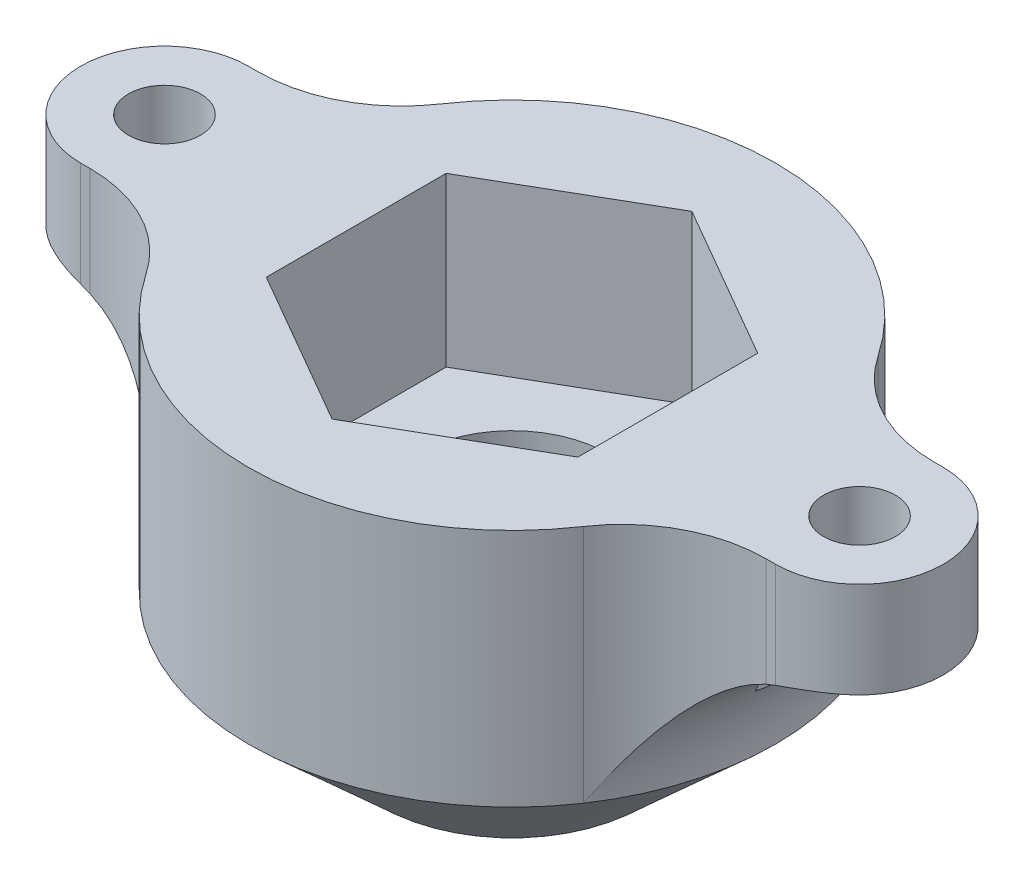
ISO-10303-21;
HEADER;
FILE_DESCRIPTION(('STEP AP214'),'2;1');
FILE_NAME('part.step','',(''),(''),'','','');
FILE_SCHEMA(('AUTOMOTIVE_DESIGN { 1 0 10303 214 1 1 1 1 }'));
ENDSEC;
DATA;
#1=APPLICATION_CONTEXT('core data for automotive mechanical design processes');
#2=APPLICATION_PROTOCOL_DEFINITION('international standard','automotive_design',2000,#1);
#3=PRODUCT_CONTEXT('',#1,'mechanical');
#4=PRODUCT('Part','Part','',(#3));
#5=PRODUCT_RELATED_PRODUCT_CATEGORY('part','',(#4));
#6=PRODUCT_DEFINITION_FORMATION('','',#4);
#7=PRODUCT_DEFINITION_CONTEXT('part definition',#1,'design');
#8=PRODUCT_DEFINITION('design','',#6,#7);
#9=PRODUCT_DEFINITION_SHAPE('','',#8);
#10=(LENGTH_UNIT() NAMED_UNIT(*) SI_UNIT(.MILLI.,.METRE.));
#11=(NAMED_UNIT(*) PLANE_ANGLE_UNIT() SI_UNIT($,.RADIAN.));
#12=(NAMED_UNIT(*) SI_UNIT($,.STERADIAN.) SOLID_ANGLE_UNIT());
#13=UNCERTAINTY_MEASURE_WITH_UNIT(LENGTH_MEASURE(1.E-05),#10,'distance_accuracy_value','');
#14=(GEOMETRIC_REPRESENTATION_CONTEXT(3) GLOBAL_UNCERTAINTY_ASSIGNED_CONTEXT((#13)) GLOBAL_UNIT_ASSIGNED_CONTEXT((#10,
#11,#12)) REPRESENTATION_CONTEXT('',''));
#15=CARTESIAN_POINT('',(0.,0.,0.));
#16=DIRECTION('',(0.,0.,1.));
#17=DIRECTION('',(1.,0.,0.));
#18=AXIS2_PLACEMENT_3D('',#15,#16,#17);
#19=CARTESIAN_POINT('',(0.,-3.,0.));
#20=DIRECTION('',(0.,1.,0.));
#21=DIRECTION('',(0.,0.,1.));
#22=AXIS2_PLACEMENT_3D('',#19,#20,#21);
#23=TOROIDAL_SURFACE('',#22,17.,6.);
#24=CARTESIAN_POINT('',(17.0002,2.99935177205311,1.73193533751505));
#25=CARTESIAN_POINT('',(16.788456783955,3.0022699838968,1.85418534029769));
#26=CARTESIAN_POINT('',(16.5766855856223,2.99532710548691,1.9764514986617));
#27=CARTESIAN_POINT('',(16.155300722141,2.96292220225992,2.21973816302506));
#28=CARTESIAN_POINT('',(15.9456815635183,2.93755640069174,2.34076184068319));
#29=CARTESIAN_POINT('',(15.5287322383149,2.86953770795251,2.58148764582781));
#30=CARTESIAN_POINT('',(15.321400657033,2.82689619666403,2.70119059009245));
#31=CARTESIAN_POINT('',(14.9086561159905,2.72512695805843,2.93948876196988));
#32=CARTESIAN_POINT('',(14.7032587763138,2.66591450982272,3.05807497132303));
#33=CARTESIAN_POINT('',(14.4998,2.59904721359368,3.1755419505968));
#34=B_SPLINE_CURVE_WITH_KNOTS('',3,(#24,#25,#26,#27,#28,#29,#30,#31,#32,#33),.UNSPECIFIED.,.F.,
.F.,(4,2,2,2,4),(0.,0.733231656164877,1.46266092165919,2.19161047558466,2.92435718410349),.UNSPECIFIED.);
#35=CARTESIAN_POINT('',(16.9058808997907,3.,1.78639049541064));
#36=VERTEX_POINT('',#35);
#37=CARTESIAN_POINT('',(14.5,2.59911294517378,3.17542648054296));
#38=VERTEX_POINT('',#37);
#39=EDGE_CURVE('E11',#36,#38,#34,.T.);
#40=ORIENTED_EDGE('',*,*,#39,.F.);
#41=CARTESIAN_POINT('',(0.,3.,0.));
#42=DIRECTION('',(0.,1.,0.));
#43=DIRECTION('',(0.,0.,1.));
#44=AXIS2_PLACEMENT_3D('',#41,#42,#43);
#45=CIRCLE('',#44,17.);
#46=CARTESIAN_POINT('',(16.7931034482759,3.,2.64417786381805));
#47=VERTEX_POINT('',#46);
#48=EDGE_CURVE('E439',#47,#36,#45,.T.);
#49=ORIENTED_EDGE('',*,*,#48,.F.);
#50=CARTESIAN_POINT('',(14.5,2.62661108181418,3.5));
#51=CARTESIAN_POINT('',(14.5845244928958,2.65705434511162,3.50001679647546));
#52=CARTESIAN_POINT('',(14.6697962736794,2.68543410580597,3.49693816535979));
#53=CARTESIAN_POINT('',(14.8411226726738,2.73812613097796,3.48439135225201));
#54=CARTESIAN_POINT('',(14.9271772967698,2.76243836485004,3.47492312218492));
#55=CARTESIAN_POINT('',(15.0992103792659,2.80701656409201,3.44942004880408));
#56=CARTESIAN_POINT('',(15.1851887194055,2.82728932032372,3.43339636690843));
#57=CARTESIAN_POINT('',(15.3564434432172,2.86399923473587,3.39473443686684));
#58=CARTESIAN_POINT('',(15.4417198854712,2.88043671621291,3.37209674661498));
#59=CARTESIAN_POINT('',(15.695568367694,2.92434742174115,3.29421817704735));
#60=CARTESIAN_POINT('',(15.8621446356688,2.94641517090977,3.22901396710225));
#61=CARTESIAN_POINT('',(16.1840434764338,2.978539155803,3.07342508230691));
#62=CARTESIAN_POINT('',(16.3393789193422,2.988609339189,2.98306979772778));
#63=CARTESIAN_POINT('',(16.5400580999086,2.99624703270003,2.84470798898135));
#64=CARTESIAN_POINT('',(16.5922566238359,2.9976918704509,2.80653720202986));
#65=CARTESIAN_POINT('',(16.6943857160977,2.99956693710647,2.72742137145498));
#66=CARTESIAN_POINT('',(16.7443199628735,2.9999988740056,2.68648111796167));
#67=CARTESIAN_POINT('',(16.7931034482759,3.,2.64417786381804));
#68=B_SPLINE_CURVE_WITH_KNOTS('',3,(#50,#51,#52,#53,#54,#55,#56,#57,#58,#59,#60,#61,#62,#63,#64,
#65,#66,#67),.UNSPECIFIED.,.F.,.F.,(4,2,2,2,2,2,2,2,4),(0.,0.269444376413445,0.538890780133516,
0.807880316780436,1.07684717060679,1.61482688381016,2.15218056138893,2.34614587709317,
2.53978388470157),.UNSPECIFIED.);
#69=CARTESIAN_POINT('',(14.5,2.62661108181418,3.5));
#70=VERTEX_POINT('',#69);
#71=EDGE_CURVE('E518',#70,#47,#68,.T.);
#72=ORIENTED_EDGE('',*,*,#71,.F.);
#73=CARTESIAN_POINT('',(14.0978721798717,2.46612546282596,3.5));
#74=CARTESIAN_POINT('',(14.1639787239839,2.49516512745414,3.5));
#75=CARTESIAN_POINT('',(14.2305426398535,2.52305875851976,3.5));
#76=CARTESIAN_POINT('',(14.3645852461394,2.57655396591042,3.5));
#77=CARTESIAN_POINT('',(14.4320639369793,2.60215554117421,3.5));
#78=CARTESIAN_POINT('',(14.5,2.62661108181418,3.5));
#79=B_SPLINE_CURVE_WITH_KNOTS('',3,(#73,#74,#75,#76,#77,#78),.UNSPECIFIED.,.F.,.F.,(4,2,4),(0.,
0.216516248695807,0.433032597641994),.UNSPECIFIED.);
#80=CARTESIAN_POINT('',(14.0978721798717,2.46612546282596,3.5));
#81=VERTEX_POINT('',#80);
#82=EDGE_CURVE('E524',#81,#70,#79,.T.);
#83=ORIENTED_EDGE('',*,*,#82,.F.);
#84=CARTESIAN_POINT('',(14.0978721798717,2.46612546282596,3.5));
#85=CARTESIAN_POINT('',(13.9295880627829,2.3922410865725,3.49999337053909));
#86=CARTESIAN_POINT('',(13.7644532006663,2.31168918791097,3.50707643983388));
#87=CARTESIAN_POINT('',(13.4418141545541,2.13916651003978,3.53378748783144));
#88=CARTESIAN_POINT('',(13.2842919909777,2.04722466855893,3.55338418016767));
#89=CARTESIAN_POINT('',(12.9793726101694,1.85472192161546,3.60317581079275));
#90=CARTESIAN_POINT('',(12.8318698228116,1.75428964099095,3.63322861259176));
#91=CARTESIAN_POINT('',(12.5449624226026,1.54521386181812,3.70256397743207));
#92=CARTESIAN_POINT('',(12.4055640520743,1.4365641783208,3.74185354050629));
#93=CARTESIAN_POINT('',(12.0829968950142,1.1693589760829,3.84500562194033));
#94=CARTESIAN_POINT('',(11.9035888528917,1.00766779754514,3.91250948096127));
#95=CARTESIAN_POINT('',(11.5599965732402,0.674179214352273,4.05994900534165));
#96=CARTESIAN_POINT('',(11.3958167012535,0.502378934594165,4.1398882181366));
#97=CARTESIAN_POINT('',(11.0807748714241,0.14994217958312,4.31064294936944));
#98=CARTESIAN_POINT('',(10.9300045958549,-0.0307436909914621,4.40152462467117));
#99=CARTESIAN_POINT('',(10.6419552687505,-0.397959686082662,4.59220339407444));
#100=CARTESIAN_POINT('',(10.5046745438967,-0.584489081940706,4.69199937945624));
#101=CARTESIAN_POINT('',(10.2487159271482,-0.953031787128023,4.89463618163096));
#102=CARTESIAN_POINT('',(10.1294688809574,-1.13484965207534,4.99711759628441));
#103=CARTESIAN_POINT('',(9.90157878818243,-1.50125714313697,5.20869523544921));
#104=CARTESIAN_POINT('',(9.79293624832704,-1.68584690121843,5.31779177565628));
#105=CARTESIAN_POINT('',(9.58596564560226,-2.05627479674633,5.54198162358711));
#106=CARTESIAN_POINT('',(9.48760981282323,-2.24210805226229,5.65705746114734));
#107=CARTESIAN_POINT('',(9.30047252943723,-2.61461063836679,5.89338581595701));
#108=CARTESIAN_POINT('',(9.21168876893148,-2.80127975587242,6.01463683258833));
#109=CARTESIAN_POINT('',(9.12577223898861,-2.99195253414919,6.14169200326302));
#110=CARTESIAN_POINT('',(9.1239613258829,-2.99597627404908,6.14437468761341));
#111=CARTESIAN_POINT('',(9.1221525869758,-3.,6.14705882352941));
#112=B_SPLINE_CURVE_WITH_KNOTS('',3,(#84,#85,#86,#87,#88,#89,#90,#91,#92,#93,#94,#95,#96,#97,
#98,#99,#100,#101,#102,#103,#104,#105,#106,#107,#108,#109,#110,#111),.UNSPECIFIED.,.F.,.F.,(4,2,
2,2,2,2,2,2,2,2,2,2,2,4),(0.,0.550790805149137,1.10020989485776,1.64243473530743,
2.18507183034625,2.93619690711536,3.68753665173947,4.44367146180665,5.19971235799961,
5.92047278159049,6.6412676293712,7.36006346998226,8.07868546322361,8.0941773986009),.UNSPECIFIED.);
#113=CARTESIAN_POINT('',(9.12215258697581,-2.99999999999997,6.14705882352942));
#114=VERTEX_POINT('',#113);
#115=EDGE_CURVE('E534',#81,#114,#112,.T.);
#116=ORIENTED_EDGE('',*,*,#115,.T.);
#117=CARTESIAN_POINT('',(0.,-3.,0.));
#118=DIRECTION('',(0.,-1.,0.));
#119=DIRECTION('',(1.,0.,0.));
#120=AXIS2_PLACEMENT_3D('',#117,#118,#119);
#121=CIRCLE('',#120,11.);
#122=CARTESIAN_POINT('',(9.12215258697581,-2.99999999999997,-6.14705882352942));
#123=VERTEX_POINT('',#122);
#124=EDGE_CURVE('E348',#123,#114,#121,.T.);
#125=ORIENTED_EDGE('',*,*,#124,.F.);
#126=CARTESIAN_POINT('',(14.0978721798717,2.46612546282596,-3.5));
#127=CARTESIAN_POINT('',(13.9295880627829,2.3922410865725,-3.49999337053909));
#128=CARTESIAN_POINT('',(13.7644532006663,2.31168918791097,-3.50707643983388));
#129=CARTESIAN_POINT('',(13.4418141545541,2.13916651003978,-3.53378748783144));
#130=CARTESIAN_POINT('',(13.2842919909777,2.04722466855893,-3.55338418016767));
#131=CARTESIAN_POINT('',(12.9793726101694,1.85472192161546,-3.60317581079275));
#132=CARTESIAN_POINT('',(12.8318698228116,1.75428964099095,-3.63322861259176));
#133=CARTESIAN_POINT('',(12.5449624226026,1.54521386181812,-3.70256397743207));
#134=CARTESIAN_POINT('',(12.4055640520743,1.4365641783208,-3.74185354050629));
#135=CARTESIAN_POINT('',(12.0829968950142,1.1693589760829,-3.84500562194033));
#136=CARTESIAN_POINT('',(11.9035888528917,1.00766779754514,-3.91250948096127));
#137=CARTESIAN_POINT('',(11.5599965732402,0.674179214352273,-4.05994900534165));
#138=CARTESIAN_POINT('',(11.3958167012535,0.502378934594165,-4.1398882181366));
#139=CARTESIAN_POINT('',(11.0807748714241,0.14994217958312,-4.31064294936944));
#140=CARTESIAN_POINT('',(10.9300045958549,-0.0307436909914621,-4.40152462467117));
#141=CARTESIAN_POINT('',(10.6419552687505,-0.397959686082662,-4.59220339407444));
#142=CARTESIAN_POINT('',(10.5046745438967,-0.584489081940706,-4.69199937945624));
#143=CARTESIAN_POINT('',(10.2487159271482,-0.953031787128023,-4.89463618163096));
#144=CARTESIAN_POINT('',(10.1294688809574,-1.13484965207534,-4.99711759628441));
#145=CARTESIAN_POINT('',(9.90157878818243,-1.50125714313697,-5.20869523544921));
#146=CARTESIAN_POINT('',(9.79293624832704,-1.68584690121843,-5.31779177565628));
#147=CARTESIAN_POINT('',(9.58596564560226,-2.05627479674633,-5.54198162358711));
#148=CARTESIAN_POINT('',(9.48760981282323,-2.24210805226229,-5.65705746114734));
#149=CARTESIAN_POINT('',(9.30047252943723,-2.61461063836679,-5.89338581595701));
#150=CARTESIAN_POINT('',(9.21168876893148,-2.80127975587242,-6.01463683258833));
#151=CARTESIAN_POINT('',(9.12577223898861,-2.99195253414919,-6.14169200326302));
#152=CARTESIAN_POINT('',(9.1239613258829,-2.99597627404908,-6.14437468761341));
#153=CARTESIAN_POINT('',(9.1221525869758,-3.,-6.14705882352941));
#154=B_SPLINE_CURVE_WITH_KNOTS('',3,(#126,#127,#128,#129,#130,#131,#132,#133,#134,#135,#136,
#137,#138,#139,#140,#141,#142,#143,#144,#145,#146,#147,#148,#149,#150,#151,#152,#153),
.UNSPECIFIED.,.F.,.F.,(4,2,2,2,2,2,2,2,2,2,2,2,2,4),(0.,0.550790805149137,1.10020989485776,
1.64243473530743,2.18507183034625,2.93619690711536,3.68753665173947,4.44367146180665,
5.19971235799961,5.92047278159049,6.6412676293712,7.36006346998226,8.07868546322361,
8.0941773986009),.UNSPECIFIED.);
#155=CARTESIAN_POINT('',(14.0978721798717,2.46612546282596,-3.5));
#156=VERTEX_POINT('',#155);
#157=EDGE_CURVE('E309',#156,#123,#154,.T.);
#158=ORIENTED_EDGE('',*,*,#157,.F.);
#159=CARTESIAN_POINT('',(14.5,2.62661108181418,-3.5));
#160=CARTESIAN_POINT('',(14.4320639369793,2.60215554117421,-3.5));
#161=CARTESIAN_POINT('',(14.3645852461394,2.57655396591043,-3.5));
#162=CARTESIAN_POINT('',(14.2305426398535,2.52305875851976,-3.5));
#163=CARTESIAN_POINT('',(14.1639787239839,2.49516512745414,-3.5));
#164=CARTESIAN_POINT('',(14.0978721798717,2.46612546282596,-3.5));
#165=B_SPLINE_CURVE_WITH_KNOTS('',3,(#159,#160,#161,#162,#163,#164),.UNSPECIFIED.,.F.,.F.,(4,2,
4),(0.,0.216516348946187,0.433032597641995),.UNSPECIFIED.);
#166=CARTESIAN_POINT('',(14.5,2.62661108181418,-3.5));
#167=VERTEX_POINT('',#166);
#168=EDGE_CURVE('E496',#167,#156,#165,.T.);
#169=ORIENTED_EDGE('',*,*,#168,.F.);
#170=CARTESIAN_POINT('',(16.7931034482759,3.,-2.64417786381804));
#171=CARTESIAN_POINT('',(16.7239951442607,3.00000016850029,-2.70412575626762));
#172=CARTESIAN_POINT('',(16.6525156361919,2.99913141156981,-2.76135202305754));
#173=CARTESIAN_POINT('',(16.5053177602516,2.99524415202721,-2.87002626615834));
#174=CARTESIAN_POINT('',(16.4295982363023,2.99222506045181,-2.92147265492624));
#175=CARTESIAN_POINT('',(16.2743465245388,2.98361836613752,-3.01829108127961));
#176=CARTESIAN_POINT('',(16.194808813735,2.97802693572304,-3.06365393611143));
#177=CARTESIAN_POINT('',(16.0326432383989,2.96387539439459,-3.14791215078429));
#178=CARTESIAN_POINT('',(15.9500158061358,2.95531569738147,-3.18680841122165));
#179=CARTESIAN_POINT('',(15.7821037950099,2.93482840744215,-3.25799744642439));
#180=CARTESIAN_POINT('',(15.6968127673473,2.92289196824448,-3.29027248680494));
#181=CARTESIAN_POINT('',(15.5245141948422,2.89533031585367,-3.34792806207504));
#182=CARTESIAN_POINT('',(15.437506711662,2.87970523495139,-3.37330884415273));
#183=CARTESIAN_POINT('',(15.2627562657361,2.84454009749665,-3.41705976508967));
#184=CARTESIAN_POINT('',(15.1750155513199,2.82500946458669,-3.43544647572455));
#185=CARTESIAN_POINT('',(14.9994155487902,2.7818258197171,-3.46532968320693));
#186=CARTESIAN_POINT('',(14.9115563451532,2.75817493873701,-3.47682972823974));
#187=CARTESIAN_POINT('',(14.7696327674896,2.71640570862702,-3.4900265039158));
#188=CARTESIAN_POINT('',(14.7153668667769,2.69958267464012,-3.49378636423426));
#189=CARTESIAN_POINT('',(14.6073042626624,2.66431608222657,-3.49877277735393));
#190=CARTESIAN_POINT('',(14.5535071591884,2.64587409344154,-3.50000175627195));
#191=CARTESIAN_POINT('',(14.5,2.62661108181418,-3.5));
#192=B_SPLINE_CURVE_WITH_KNOTS('',3,(#170,#171,#172,#173,#174,#175,#176,#177,#178,#179,#180,
#181,#182,#183,#184,#185,#186,#187,#188,#189,#190,#191),.UNSPECIFIED.,.F.,.F.,(4,2,2,2,2,2,2,2,
2,2,4),(0.,0.27439591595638,0.548867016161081,0.823747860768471,1.09859039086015,
1.37415971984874,1.64971916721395,1.92462157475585,2.19938222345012,2.37012153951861,
2.54069710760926),.UNSPECIFIED.);
#193=CARTESIAN_POINT('',(16.7931034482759,3.,-2.64417786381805));
#194=VERTEX_POINT('',#193);
#195=EDGE_CURVE('E489',#194,#167,#192,.T.);
#196=ORIENTED_EDGE('',*,*,#195,.F.);
#197=CARTESIAN_POINT('',(16.9058808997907,3.,-1.78639049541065));
#198=VERTEX_POINT('',#197);
#199=EDGE_CURVE('E438',#198,#194,#45,.T.);
#200=ORIENTED_EDGE('',*,*,#199,.F.);
#201=CARTESIAN_POINT('',(14.4998,2.59904721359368,-3.1755419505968));
#202=CARTESIAN_POINT('',(14.7032587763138,2.66591450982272,-3.05807497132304));
#203=CARTESIAN_POINT('',(14.9086561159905,2.72512695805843,-2.93948876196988));
#204=CARTESIAN_POINT('',(15.321400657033,2.82689619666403,-2.70119059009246));
#205=CARTESIAN_POINT('',(15.5287322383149,2.86953770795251,-2.58148764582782));
#206=CARTESIAN_POINT('',(15.9456815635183,2.93755640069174,-2.3407618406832));
#207=CARTESIAN_POINT('',(16.155300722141,2.96292220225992,-2.21973816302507));
#208=CARTESIAN_POINT('',(16.5766855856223,2.99532710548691,-1.97645149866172));
#209=CARTESIAN_POINT('',(16.788456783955,3.0022699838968,-1.85418534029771));
#210=CARTESIAN_POINT('',(17.0002,2.99935177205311,-1.73193533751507));
#211=B_SPLINE_CURVE_WITH_KNOTS('',3,(#201,#202,#203,#204,#205,#206,#207,#208,#209,#210),
.UNSPECIFIED.,.F.,.F.,(4,2,2,2,4),(0.,0.732746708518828,1.4616962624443,2.1911255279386,
2.92435718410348),.UNSPECIFIED.);
#212=CARTESIAN_POINT('',(14.5,2.59911294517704,-3.17542648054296));
#213=VERTEX_POINT('',#212);
#214=EDGE_CURVE('E255',#213,#198,#211,.T.);
#215=ORIENTED_EDGE('',*,*,#214,.F.);
#216=CARTESIAN_POINT('',(11.7498000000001,0.0895200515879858,-1.58759777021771));
#217=CARTESIAN_POINT('',(11.8351206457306,0.241286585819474,-1.63685766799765));
#218=CARTESIAN_POINT('',(11.9263459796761,0.388588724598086,-1.68952663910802));
#219=CARTESIAN_POINT('',(12.1196005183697,0.673343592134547,-1.80110219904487));
#220=CARTESIAN_POINT('',(12.2216259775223,0.810799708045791,-1.86000662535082));
#221=CARTESIAN_POINT('',(12.4327718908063,1.07163396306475,-1.98191177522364));
#222=CARTESIAN_POINT('',(12.5416408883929,1.1952840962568,-2.04476732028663));
#223=CARTESIAN_POINT('',(12.7678490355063,1.43178211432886,-2.17536865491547));
#224=CARTESIAN_POINT('',(12.8851881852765,1.54462999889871,-2.24311444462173));
#225=CARTESIAN_POINT('',(13.1181271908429,1.75064936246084,-2.37760184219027));
#226=CARTESIAN_POINT('',(13.2331674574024,1.84466653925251,-2.44402037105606));
#227=CARTESIAN_POINT('',(13.4690133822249,2.02251177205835,-2.5801860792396));
#228=CARTESIAN_POINT('',(13.5898191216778,2.10633968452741,-2.64993330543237));
#229=CARTESIAN_POINT('',(13.8395198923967,2.26531457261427,-2.79409811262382));
#230=CARTESIAN_POINT('',(13.96854063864,2.34019830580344,-2.86858827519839));
#231=CARTESIAN_POINT('',(14.2311428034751,2.47844204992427,-3.02020170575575));
#232=CARTESIAN_POINT('',(14.3647245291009,2.54180128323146,-3.0973251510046));
#233=CARTESIAN_POINT('',(14.5002,2.59919769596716,-3.1755419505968));
#234=B_SPLINE_CURVE_WITH_KNOTS('',3,(#216,#217,#218,#219,#220,#221,#222,#223,#224,#225,#226,
#227,#228,#229,#230,#231,#232,#233),.UNSPECIFIED.,.F.,.F.,(4,2,2,2,2,2,2,2,4),(0.,
0.542592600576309,1.08499763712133,1.61338697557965,2.14177632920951,2.62955059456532,
3.11733173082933,3.6170727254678,4.11684742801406),.UNSPECIFIED.);
#235=CARTESIAN_POINT('',(11.75,0.0898757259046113,-1.58771324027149));
#236=VERTEX_POINT('',#235);
#237=EDGE_CURVE('E272',#236,#213,#234,.T.);
#238=ORIENTED_EDGE('',*,*,#237,.F.);
#239=CARTESIAN_POINT('',(11.75,-0.0952624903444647,0.));
#240=CARTESIAN_POINT('',(11.75,-0.0952691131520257,-0.126767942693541));
#241=CARTESIAN_POINT('',(11.75,-0.0915399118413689,-0.253521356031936));
#242=CARTESIAN_POINT('',(11.75,-0.0768266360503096,-0.506612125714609));
#243=CARTESIAN_POINT('',(11.75,-0.0658419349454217,-0.63294944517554));
#244=CARTESIAN_POINT('',(11.75,-0.0226224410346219,-1.01111310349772));
#245=CARTESIAN_POINT('',(11.75,0.0198759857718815,-1.26179063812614));
#246=CARTESIAN_POINT('',(11.75,0.126956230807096,-1.76297224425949));
#247=CARTESIAN_POINT('',(11.75,0.191931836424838,-2.01338740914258));
#248=CARTESIAN_POINT('',(11.75,0.336611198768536,-2.50972337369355));
#249=CARTESIAN_POINT('',(11.75,0.416310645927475,-2.75564546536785));
#250=CARTESIAN_POINT('',(11.75,0.593504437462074,-3.27018757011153));
#251=CARTESIAN_POINT('',(11.75,0.691989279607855,-3.53845862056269));
#252=CARTESIAN_POINT('',(11.75,0.893939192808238,-4.07314122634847));
#253=CARTESIAN_POINT('',(11.75,0.997405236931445,-4.33955240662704));
#254=CARTESIAN_POINT('',(11.75,1.20503165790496,-4.87230032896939));
#255=CARTESIAN_POINT('',(11.75,1.30919243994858,-5.13863691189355));
#256=CARTESIAN_POINT('',(11.75,1.51477393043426,-5.67234645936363));
#257=CARTESIAN_POINT('',(11.75,1.61619491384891,-5.93971931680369));
#258=CARTESIAN_POINT('',(11.75,1.81254748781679,-6.47376081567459));
#259=CARTESIAN_POINT('',(11.75,1.90753474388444,-6.74040879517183));
#260=CARTESIAN_POINT('',(11.75,2.08980879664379,-7.27636490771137));
#261=CARTESIAN_POINT('',(11.75,2.17709512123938,-7.54567320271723));
#262=CARTESIAN_POINT('',(11.75,2.34173493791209,-8.08708354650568));
#263=CARTESIAN_POINT('',(11.75,2.41909687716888,-8.35918300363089));
#264=CARTESIAN_POINT('',(11.75,2.56190211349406,-8.90648913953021));
#265=CARTESIAN_POINT('',(11.75,2.62734666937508,-9.1816954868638));
#266=CARTESIAN_POINT('',(11.75,2.74644407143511,-9.74529467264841));
#267=CARTESIAN_POINT('',(11.75,2.7995732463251,-10.0337996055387));
#268=CARTESIAN_POINT('',(11.75,2.88855655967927,-10.6135343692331));
#269=CARTESIAN_POINT('',(11.75,2.92440895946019,-10.9047644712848));
#270=CARTESIAN_POINT('',(11.75,2.97661177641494,-11.4900098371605));
#271=CARTESIAN_POINT('',(11.75,2.99289560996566,-11.7840311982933));
#272=CARTESIAN_POINT('',(11.75,3.0033892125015,-12.3724515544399));
#273=CARTESIAN_POINT('',(11.75,2.99760563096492,-12.66685040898));
#274=CARTESIAN_POINT('',(11.75,2.96456188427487,-13.2068360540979));
#275=CARTESIAN_POINT('',(11.75,2.94091344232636,-13.4526424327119));
#276=CARTESIAN_POINT('',(11.75,2.87516247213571,-13.9416907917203));
#277=CARTESIAN_POINT('',(11.75,2.8330695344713,-14.1849340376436));
#278=CARTESIAN_POINT('',(11.75,2.72930389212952,-14.666757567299));
#279=CARTESIAN_POINT('',(11.75,2.6676686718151,-14.9053458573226));
#280=CARTESIAN_POINT('',(11.75,2.52372504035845,-15.3762095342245));
#281=CARTESIAN_POINT('',(11.75,2.44142179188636,-15.6084864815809));
#282=CARTESIAN_POINT('',(11.75,2.27580314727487,-16.0140964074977));
#283=CARTESIAN_POINT('',(11.75,2.19669535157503,-16.1891531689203));
#284=CARTESIAN_POINT('',(11.75,2.0251172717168,-16.5326531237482));
#285=CARTESIAN_POINT('',(11.75,1.93264528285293,-16.7010954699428));
#286=CARTESIAN_POINT('',(11.75,1.73420073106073,-17.0299292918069));
#287=CARTESIAN_POINT('',(11.75,1.62822375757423,-17.1903181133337));
#288=CARTESIAN_POINT('',(11.75,1.40288084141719,-17.5013896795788));
#289=CARTESIAN_POINT('',(11.75,1.28351691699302,-17.6520738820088));
#290=CARTESIAN_POINT('',(11.75,1.03059258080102,-17.9433501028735));
#291=CARTESIAN_POINT('',(11.75,0.896918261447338,-18.0838435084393));
#292=CARTESIAN_POINT('',(11.75,0.6168809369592,-18.3514443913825));
#293=CARTESIAN_POINT('',(11.75,0.470524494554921,-18.4785587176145));
#294=CARTESIAN_POINT('',(11.75,0.166013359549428,-18.7176506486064));
#295=CARTESIAN_POINT('',(11.75,0.00786414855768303,-18.82963521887));
#296=CARTESIAN_POINT('',(11.75,-0.319077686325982,-19.0368036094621));
#297=CARTESIAN_POINT('',(11.75,-0.487868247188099,-19.1319906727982));
#298=CARTESIAN_POINT('',(11.75,-0.810111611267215,-19.2918673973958));
#299=CARTESIAN_POINT('',(11.75,-0.962373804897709,-19.3589644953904));
#300=CARTESIAN_POINT('',(11.75,-1.27246533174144,-19.4787303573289));
#301=CARTESIAN_POINT('',(11.75,-1.43029388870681,-19.5314011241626));
#302=CARTESIAN_POINT('',(11.75,-1.75013470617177,-19.6215717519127));
#303=CARTESIAN_POINT('',(11.75,-1.91214456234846,-19.6590801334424));
#304=CARTESIAN_POINT('',(11.75,-2.23900789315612,-19.7184336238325));
#305=CARTESIAN_POINT('',(11.75,-2.40386115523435,-19.7402798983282));
#306=CARTESIAN_POINT('',(11.75,-2.71775430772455,-19.7665618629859));
#307=CARTESIAN_POINT('',(11.75,-2.86666498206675,-19.7725654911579));
#308=CARTESIAN_POINT('',(11.75,-3.16444439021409,-19.7716665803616));
#309=CARTESIAN_POINT('',(11.75,-3.31331312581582,-19.7647647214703));
#310=CARTESIAN_POINT('',(11.75,-3.60986042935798,-19.7381397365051));
#311=CARTESIAN_POINT('',(11.75,-3.75753927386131,-19.7184196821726));
#312=CARTESIAN_POINT('',(11.75,-4.05066214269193,-19.6663917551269));
#313=CARTESIAN_POINT('',(11.75,-4.1961061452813,-19.6340837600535));
#314=CARTESIAN_POINT('',(11.75,-4.48048931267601,-19.5581152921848));
#315=CARTESIAN_POINT('',(11.75,-4.61950120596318,-19.5147263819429));
#316=CARTESIAN_POINT('',(11.75,-4.89355546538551,-19.4167196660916));
#317=CARTESIAN_POINT('',(11.75,-5.02859650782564,-19.3620981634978));
#318=CARTESIAN_POINT('',(11.75,-5.29381422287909,-19.2422094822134));
#319=CARTESIAN_POINT('',(11.75,-5.42399228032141,-19.176945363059));
#320=CARTESIAN_POINT('',(11.75,-5.67885920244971,-19.0363718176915));
#321=CARTESIAN_POINT('',(11.75,-5.80354597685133,-18.9610586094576));
#322=CARTESIAN_POINT('',(11.75,-6.05257716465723,-18.7972746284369));
#323=CARTESIAN_POINT('',(11.75,-6.17662186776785,-18.7083477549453));
#324=CARTESIAN_POINT('',(11.75,-6.41741100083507,-18.5210778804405));
#325=CARTESIAN_POINT('',(11.75,-6.5341527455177,-18.4227314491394));
#326=CARTESIAN_POINT('',(11.75,-6.87264991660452,-18.1148786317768));
#327=CARTESIAN_POINT('',(11.75,-7.0828387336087,-17.892451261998));
#328=CARTESIAN_POINT('',(11.75,-7.49070455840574,-17.3947059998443));
#329=CARTESIAN_POINT('',(11.75,-7.68453230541,-17.1162665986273));
#330=CARTESIAN_POINT('',(11.75,-8.03038886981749,-16.5344948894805));
#331=CARTESIAN_POINT('',(11.75,-8.18239391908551,-16.2311485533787));
#332=CARTESIAN_POINT('',(11.75,-8.40902617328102,-15.693935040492));
#333=CARTESIAN_POINT('',(11.75,-8.49342435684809,-15.4640902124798));
#334=CARTESIAN_POINT('',(11.75,-8.64172986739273,-14.9978038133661));
#335=CARTESIAN_POINT('',(11.75,-8.70563022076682,-14.7613600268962));
#336=CARTESIAN_POINT('',(11.75,-8.81400249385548,-14.2836684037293));
#337=CARTESIAN_POINT('',(11.75,-8.85843975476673,-14.0424127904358));
#338=CARTESIAN_POINT('',(11.75,-8.92891902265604,-13.5572751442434));
#339=CARTESIAN_POINT('',(11.75,-8.95496076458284,-13.3133930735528));
#340=CARTESIAN_POINT('',(11.75,-8.99746875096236,-12.7189611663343));
#341=CARTESIAN_POINT('',(11.75,-9.00496517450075,-12.3677582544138));
#342=CARTESIAN_POINT('',(11.75,-8.98881247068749,-11.666066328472));
#343=CARTESIAN_POINT('',(11.75,-8.96514852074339,-11.3155777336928));
#344=CARTESIAN_POINT('',(11.75,-8.89067818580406,-10.6179503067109));
#345=CARTESIAN_POINT('',(11.75,-8.83990007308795,-10.2708083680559));
#346=CARTESIAN_POINT('',(11.75,-8.71515773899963,-9.58085899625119));
#347=CARTESIAN_POINT('',(11.75,-8.64119703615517,-9.238050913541));
#348=CARTESIAN_POINT('',(11.75,-8.46909882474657,-8.537416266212));
#349=CARTESIAN_POINT('',(11.75,-8.3698040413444,-8.17987793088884));
#350=CARTESIAN_POINT('',(11.75,-8.15422531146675,-7.46998800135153));
#351=CARTESIAN_POINT('',(11.75,-8.03793895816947,-7.11763714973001));
#352=CARTESIAN_POINT('',(11.75,-7.79216610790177,-6.4140998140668));
#353=CARTESIAN_POINT('',(11.75,-7.66257096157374,-6.06295185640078));
#354=CARTESIAN_POINT('',(11.75,-7.4632580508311,-5.53818406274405));
#355=CARTESIAN_POINT('',(11.75,-7.39600907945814,-5.36360881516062));
#356=CARTESIAN_POINT('',(11.75,-7.26071688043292,-5.01476564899));
#357=CARTESIAN_POINT('',(11.75,-7.19267365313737,-4.84049773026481));
#358=CARTESIAN_POINT('',(11.75,-7.0559729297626,-4.48989677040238));
#359=CARTESIAN_POINT('',(11.75,-6.98731734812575,-4.31356298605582));
#360=CARTESIAN_POINT('',(11.75,-6.85135647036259,-3.96036916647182));
#361=CARTESIAN_POINT('',(11.75,-6.78405119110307,-3.78350912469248));
#362=CARTESIAN_POINT('',(11.75,-6.65213002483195,-3.42849601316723));
#363=CARTESIAN_POINT('',(11.75,-6.58751806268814,-3.25034147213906));
#364=CARTESIAN_POINT('',(11.75,-6.46285033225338,-2.89242453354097));
#365=CARTESIAN_POINT('',(11.75,-6.4027946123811,-2.71266211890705));
#366=CARTESIAN_POINT('',(11.75,-6.29068420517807,-2.35506811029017));
#367=CARTESIAN_POINT('',(11.75,-6.23847989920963,-2.1772840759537));
#368=CARTESIAN_POINT('',(11.75,-6.14290237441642,-1.81930960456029));
#369=CARTESIAN_POINT('',(11.75,-6.0995293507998,-1.63911911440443));
#370=CARTESIAN_POINT('',(11.75,-6.02437526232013,-1.27686671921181));
#371=CARTESIAN_POINT('',(11.75,-5.99255878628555,-1.09481231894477));
#372=CARTESIAN_POINT('',(11.75,-5.94281750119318,-0.72881491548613));
#373=CARTESIAN_POINT('',(11.75,-5.92488782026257,-0.544872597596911));
#374=CARTESIAN_POINT('',(11.75,-5.90726678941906,-0.225725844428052));
#375=CARTESIAN_POINT('',(11.75,-5.90396785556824,-0.0907146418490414));
#376=CARTESIAN_POINT('',(11.75,-5.90580858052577,0.179249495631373));
#377=CARTESIAN_POINT('',(11.75,-5.91094793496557,0.314202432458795));
#378=CARTESIAN_POINT('',(11.75,-5.9294115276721,0.583692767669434));
#379=CARTESIAN_POINT('',(11.75,-5.94274510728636,0.718229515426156));
#380=CARTESIAN_POINT('',(11.75,-5.97694233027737,0.986331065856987));
#381=CARTESIAN_POINT('',(11.75,-5.99780635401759,1.11989581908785));
#382=CARTESIAN_POINT('',(11.75,-6.0711729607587,1.52328770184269));
#383=CARTESIAN_POINT('',(11.75,-6.13408409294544,1.79122286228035));
#384=CARTESIAN_POINT('',(11.75,-6.27870346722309,2.32175019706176));
#385=CARTESIAN_POINT('',(11.75,-6.36041566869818,2.58434123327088));
#386=CARTESIAN_POINT('',(11.75,-6.53750683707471,3.11269706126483));
#387=CARTESIAN_POINT('',(11.75,-6.63319548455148,3.37835582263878));
#388=CARTESIAN_POINT('',(11.75,-6.83047076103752,3.90749276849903));
#389=CARTESIAN_POINT('',(11.75,-6.93205871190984,4.17097044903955));
#390=CARTESIAN_POINT('',(11.75,-7.13670881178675,4.69749029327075));
#391=CARTESIAN_POINT('',(11.75,-7.23977163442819,4.96053219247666));
#392=CARTESIAN_POINT('',(11.75,-7.44390370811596,5.48736284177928));
#393=CARTESIAN_POINT('',(11.75,-7.54497318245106,5.75115150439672));
#394=CARTESIAN_POINT('',(11.75,-7.74148508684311,6.27815097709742));
#395=CARTESIAN_POINT('',(11.75,-7.83696972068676,6.54134589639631));
#396=CARTESIAN_POINT('',(11.75,-8.02096034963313,7.07020126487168));
#397=CARTESIAN_POINT('',(11.75,-8.10946594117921,7.33586185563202));
#398=CARTESIAN_POINT('',(11.75,-8.27730645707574,7.8698621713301));
#399=CARTESIAN_POINT('',(11.75,-8.35664851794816,8.13819963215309));
#400=CARTESIAN_POINT('',(11.75,-8.50422011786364,8.67790513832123));
#401=CARTESIAN_POINT('',(11.75,-8.57245067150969,8.94927290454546));
#402=CARTESIAN_POINT('',(11.75,-8.70101045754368,9.5179246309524));
#403=CARTESIAN_POINT('',(11.75,-8.76019638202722,9.81547264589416));
#404=CARTESIAN_POINT('',(11.75,-8.8606827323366,10.4135632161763));
#405=CARTESIAN_POINT('',(11.75,-8.90198103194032,10.714106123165));
#406=CARTESIAN_POINT('',(11.75,-8.99539220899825,11.6209830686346));
#407=CARTESIAN_POINT('',(11.75,-9.01666616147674,12.231100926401));
#408=CARTESIAN_POINT('',(11.75,-8.96167095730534,13.3348467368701));
#409=CARTESIAN_POINT('',(11.75,-8.90266474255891,13.8292101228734));
#410=CARTESIAN_POINT('',(11.75,-8.75512162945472,14.5581391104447));
#411=CARTESIAN_POINT('',(11.75,-8.69617085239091,14.7988291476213));
#412=CARTESIAN_POINT('',(11.75,-8.55750373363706,15.27419375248));
#413=CARTESIAN_POINT('',(11.75,-8.47779246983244,15.5088697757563));
#414=CARTESIAN_POINT('',(11.75,-8.31648653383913,15.9194250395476));
#415=CARTESIAN_POINT('',(11.75,-8.23909562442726,16.0969633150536));
#416=CARTESIAN_POINT('',(11.75,-8.07076887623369,16.4455623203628));
#417=CARTESIAN_POINT('',(11.75,-7.97983131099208,16.6166222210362));
#418=CARTESIAN_POINT('',(11.75,-7.78423496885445,16.9508229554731));
#419=CARTESIAN_POINT('',(11.75,-7.67957079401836,17.1139606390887));
#420=CARTESIAN_POINT('',(11.75,-7.45660522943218,17.4306270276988));
#421=CARTESIAN_POINT('',(11.75,-7.33830593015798,17.5841572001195));
#422=CARTESIAN_POINT('',(11.75,-7.08722032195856,17.8812426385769));
#423=CARTESIAN_POINT('',(11.75,-6.95431553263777,18.0246980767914));
#424=CARTESIAN_POINT('',(11.75,-6.67550246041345,18.2982479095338));
#425=CARTESIAN_POINT('',(11.75,-6.52960096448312,18.4283492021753));
#426=CARTESIAN_POINT('',(11.75,-6.22566969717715,18.6733883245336));
#427=CARTESIAN_POINT('',(11.75,-6.06764602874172,18.7883337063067));
#428=CARTESIAN_POINT('',(11.75,-5.74060901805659,19.0013483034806));
#429=CARTESIAN_POINT('',(11.75,-5.5715978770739,19.0994208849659));
#430=CARTESIAN_POINT('',(11.75,-5.24908978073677,19.2642969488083));
#431=CARTESIAN_POINT('',(11.75,-5.09685048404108,19.3335683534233));
#432=CARTESIAN_POINT('',(11.75,-4.78658955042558,19.4576367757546));
#433=CARTESIAN_POINT('',(11.75,-4.62856874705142,19.5124358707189));
#434=CARTESIAN_POINT('',(11.75,-4.30813262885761,19.6067827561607));
#435=CARTESIAN_POINT('',(11.75,-4.14571989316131,19.646339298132));
#436=CARTESIAN_POINT('',(11.75,-3.81784767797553,19.7096779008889));
#437=CARTESIAN_POINT('',(11.75,-3.65238843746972,19.7334611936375));
#438=CARTESIAN_POINT('',(11.75,-3.33764343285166,19.7632369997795));
#439=CARTESIAN_POINT('',(11.75,-3.18850902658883,19.7708525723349));
#440=CARTESIAN_POINT('',(11.75,-2.89014455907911,19.7731265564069));
#441=CARTESIAN_POINT('',(11.75,-2.74091450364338,19.767785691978));
#442=CARTESIAN_POINT('',(11.75,-2.44351665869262,19.7442133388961));
#443=CARTESIAN_POINT('',(11.75,-2.29534861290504,19.7259850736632));
#444=CARTESIAN_POINT('',(11.75,-2.0011291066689,19.6768557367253));
#445=CARTESIAN_POINT('',(11.75,-1.8550776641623,19.6459545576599));
#446=CARTESIAN_POINT('',(11.75,-1.56972723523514,19.5727571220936));
#447=CARTESIAN_POINT('',(11.75,-1.43035062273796,19.5307626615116));
#448=CARTESIAN_POINT('',(11.75,-1.15546052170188,19.4354939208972));
#449=CARTESIAN_POINT('',(11.75,-1.01994832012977,19.3822159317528));
#450=CARTESIAN_POINT('',(11.75,-0.753693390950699,19.2649517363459));
#451=CARTESIAN_POINT('',(11.75,-0.622949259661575,19.2009687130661));
#452=CARTESIAN_POINT('',(11.75,-0.366864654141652,19.0628861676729));
#453=CARTESIAN_POINT('',(11.75,-0.241526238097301,18.9887828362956));
#454=CARTESIAN_POINT('',(11.75,0.0086767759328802,18.8275492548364));
#455=CARTESIAN_POINT('',(11.75,0.13325758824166,18.739978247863));
#456=CARTESIAN_POINT('',(11.75,0.37521356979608,18.5553627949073));
#457=CARTESIAN_POINT('',(11.75,0.492586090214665,18.4583148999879));
#458=CARTESIAN_POINT('',(11.75,0.833102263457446,18.1542571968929));
#459=CARTESIAN_POINT('',(11.75,1.04480515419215,17.9342286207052));
#460=CARTESIAN_POINT('',(11.75,1.45577984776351,17.4416296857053));
#461=CARTESIAN_POINT('',(11.75,1.65129317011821,17.1659560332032));
#462=CARTESIAN_POINT('',(11.75,2.00082164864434,16.5894232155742));
#463=CARTESIAN_POINT('',(11.75,2.15481532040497,16.2885511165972));
#464=CARTESIAN_POINT('',(11.75,2.38472515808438,15.7560852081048));
#465=CARTESIAN_POINT('',(11.75,2.47043503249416,15.5286190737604));
#466=CARTESIAN_POINT('',(11.75,2.62157441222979,15.0669682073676));
#467=CARTESIAN_POINT('',(11.75,2.68699709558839,14.832781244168));
#468=CARTESIAN_POINT('',(11.75,2.79859560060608,14.3594320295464));
#469=CARTESIAN_POINT('',(11.75,2.84473372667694,14.1202609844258));
#470=CARTESIAN_POINT('',(11.75,2.9187397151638,13.6391534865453));
#471=CARTESIAN_POINT('',(11.75,2.94660728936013,13.3972169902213));
#472=CARTESIAN_POINT('',(11.75,2.99353891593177,12.808919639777));
#473=CARTESIAN_POINT('',(11.75,3.00383753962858,12.4618481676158));
#474=CARTESIAN_POINT('',(11.75,2.99364388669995,11.7681543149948));
#475=CARTESIAN_POINT('',(11.75,2.97313717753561,11.4215322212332));
#476=CARTESIAN_POINT('',(11.75,2.90521667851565,10.7315914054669));
#477=CARTESIAN_POINT('',(11.75,2.85784711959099,10.3882681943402));
#478=CARTESIAN_POINT('',(11.75,2.74003641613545,9.70574390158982));
#479=CARTESIAN_POINT('',(11.75,2.66959870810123,9.36654221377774));
#480=CARTESIAN_POINT('',(11.75,2.49886132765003,8.64851331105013));
#481=CARTESIAN_POINT('',(11.75,2.39585347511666,8.27033809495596));
#482=CARTESIAN_POINT('',(11.75,2.17053552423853,7.51981400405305));
#483=CARTESIAN_POINT('',(11.75,2.04822176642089,7.14746624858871));
#484=CARTESIAN_POINT('',(11.75,1.78862532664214,6.40357779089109));
#485=CARTESIAN_POINT('',(11.75,1.65119486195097,6.03208951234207));
#486=CARTESIAN_POINT('',(11.75,1.43978549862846,5.47694661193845));
#487=CARTESIAN_POINT('',(11.75,1.36844579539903,5.29226550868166));
#488=CARTESIAN_POINT('',(11.75,1.2250335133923,4.9231872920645));
#489=CARTESIAN_POINT('',(11.75,1.15296093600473,4.73879017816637));
#490=CARTESIAN_POINT('',(11.75,1.00866324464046,4.36830903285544));
#491=CARTESIAN_POINT('',(11.75,0.936441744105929,4.1822235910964));
#492=CARTESIAN_POINT('',(11.75,0.793891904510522,3.80931946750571));
#493=CARTESIAN_POINT('',(11.75,0.723563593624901,3.62250077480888));
#494=CARTESIAN_POINT('',(11.75,0.586486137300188,3.24723824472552));
#495=CARTESIAN_POINT('',(11.75,0.519742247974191,3.0587924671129));
#496=CARTESIAN_POINT('',(11.75,0.392169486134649,2.67987442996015));
#497=CARTESIAN_POINT('',(11.75,0.331340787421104,2.48940211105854));
#498=CARTESIAN_POINT('',(11.75,0.21974234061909,2.11059723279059));
#499=CARTESIAN_POINT('',(11.75,0.168761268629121,1.92232800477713));
#500=CARTESIAN_POINT('',(11.75,0.0780159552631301,1.54305397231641));
#501=CARTESIAN_POINT('',(11.75,0.0382510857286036,1.35204932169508));
#502=CARTESIAN_POINT('',(11.75,-0.0268751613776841,0.968255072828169));
#503=CARTESIAN_POINT('',(11.75,-0.0522887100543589,0.775474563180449));
#504=CARTESIAN_POINT('',(11.75,-0.0864741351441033,0.388450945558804));
#505=CARTESIAN_POINT('',(11.75,-0.0952523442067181,0.194208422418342));
#506=CARTESIAN_POINT('',(11.75,-0.0952624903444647,0.));
#507=B_SPLINE_CURVE_WITH_KNOTS('',3,(#239,#240,#241,#242,#243,#244,#245,#246,#247,#248,#249,
#250,#251,#252,#253,#254,#255,#256,#257,#258,#259,#260,#261,#262,#263,#264,#265,#266,#267,#268,
#269,#270,#271,#272,#273,#274,#275,#276,#277,#278,#279,#280,#281,#282,#283,#284,#285,#286,#287,
#288,#289,#290,#291,#292,#293,#294,#295,#296,#297,#298,#299,#300,#301,#302,#303,#304,#305,#306,
#307,#308,#309,#310,#311,#312,#313,#314,#315,#316,#317,#318,#319,#320,#321,#322,#323,#324,#325,
#326,#327,#328,#329,#330,#331,#332,#333,#334,#335,#336,#337,#338,#339,#340,#341,#342,#343,#344,
#345,#346,#347,#348,#349,#350,#351,#352,#353,#354,#355,#356,#357,#358,#359,#360,#361,#362,#363,
#364,#365,#366,#367,#368,#369,#370,#371,#372,#373,#374,#375,#376,#377,#378,#379,#380,#381,#382,
#383,#384,#385,#386,#387,#388,#389,#390,#391,#392,#393,#394,#395,#396,#397,#398,#399,#400,#401,
#402,#403,#404,#405,#406,#407,#408,#409,#410,#411,#412,#413,#414,#415,#416,#417,#418,#419,#420,
#421,#422,#423,#424,#425,#426,#427,#428,#429,#430,#431,#432,#433,#434,#435,#436,#437,#438,#439,
#440,#441,#442,#443,#444,#445,#446,#447,#448,#449,#450,#451,#452,#453,#454,#455,#456,#457,#458,
#459,#460,#461,#462,#463,#464,#465,#466,#467,#468,#469,#470,#471,#472,#473,#474,#475,#476,#477,
#478,#479,#480,#481,#482,#483,#484,#485,#486,#487,#488,#489,#490,#491,#492,#493,#494,#495,#496,
#497,#498,#499,#500,#501,#502,#503,#504,#505,#506),.UNSPECIFIED.,.T.,.F.,(4,2,2,2,2,2,2,2,2,2,2,
2,2,2,2,2,2,2,2,2,2,2,2,2,2,2,2,2,2,2,2,2,2,2,2,2,2,2,2,2,2,2,2,2,2,2,2,2,2,2,2,2,2,2,2,2,2,2,2,
2,2,2,2,2,2,2,2,2,2,2,2,2,2,2,2,2,2,2,2,2,2,2,2,2,2,2,2,2,2,2,2,2,2,2,2,2,2,2,2,2,2,2,2,2,2,2,2,
2,2,2,2,2,2,2,2,2,2,2,2,2,2,2,2,2,2,2,2,2,2,2,2,2,2,4),(0.,0.380222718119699,0.760478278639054,
1.5218857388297,2.29737143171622,3.07263050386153,3.92984956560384,4.78723676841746,
5.64517758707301,6.50303197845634,7.35213129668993,8.20128263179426,9.04970634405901,
9.89804038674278,10.7776497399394,11.6573475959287,12.5400302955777,13.4224470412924,
14.162640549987,14.9024496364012,15.6408481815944,16.3790624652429,16.9548408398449,
17.5306927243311,18.1067331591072,18.6826868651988,19.2636244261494,19.8442631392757,
20.4246336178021,21.0048919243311,21.503378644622,22.0017961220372,22.4999331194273,
22.9980330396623,23.4445809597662,23.8911053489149,24.3375227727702,24.7839445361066,
25.2203296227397,25.6568585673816,26.0932622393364,26.5298306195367,26.9872119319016,
27.444760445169,28.3592817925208,29.3733011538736,30.3878956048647,31.121523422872,
31.8554005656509,32.5905792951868,33.3257686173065,34.3779448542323,35.4306217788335,
36.4822032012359,37.5336250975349,38.6462875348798,39.7591077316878,40.8818699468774,
41.4431110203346,42.0043518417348,42.5720349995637,43.1397252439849,43.7082157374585,
44.2767122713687,44.8324177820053,45.3881355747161,45.9421358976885,46.4959417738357,
46.9008458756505,47.3057353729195,47.7110872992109,48.1164597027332,48.9409457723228,
49.765605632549,50.6125532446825,51.4596913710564,52.3072296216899,53.1546723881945,
53.9945443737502,54.8344648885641,55.673726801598,56.5129120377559,57.4225091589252,
58.3322143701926,60.1561135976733,61.6436984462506,62.3863283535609,63.1287767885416,
63.7092705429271,64.2898383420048,64.8706351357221,65.4513430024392,66.0371683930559,
66.6226896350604,67.2079180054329,67.7930294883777,68.2941132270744,68.7951250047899,
69.295848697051,69.7965332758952,70.2439697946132,70.6913813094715,71.1386809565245,
71.5859843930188,72.022188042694,72.4585353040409,72.8947530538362,73.3311354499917,
73.7874738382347,74.2439789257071,75.156419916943,76.166564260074,77.1772303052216,
77.9055506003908,78.6341155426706,79.3640980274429,80.0940920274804,81.1341166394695,
82.1746286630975,83.2134323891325,84.252081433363,85.4272540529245,86.6026496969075,
87.7907763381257,88.3847214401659,88.9786654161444,89.5774901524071,90.1763237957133,
90.7760128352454,91.3757194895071,91.9606151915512,92.5454781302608,93.1282010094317,
93.7107020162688),.UNSPECIFIED.);
#508=CARTESIAN_POINT('',(11.75,0.,-1.12619608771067));
#509=VERTEX_POINT('',#508);
#510=EDGE_CURVE('E708',#509,#236,#507,.T.);
#511=ORIENTED_EDGE('',*,*,#510,.F.);
#512=CARTESIAN_POINT('',(0.,0.,0.));
#513=DIRECTION('',(0.,-1.,0.));
#514=DIRECTION('',(0.,0.,-1.));
#515=AXIS2_PLACEMENT_3D('',#512,#513,#514);
#516=CIRCLE('',#515,11.8038475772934);
#517=CARTESIAN_POINT('',(11.75,0.,1.1261960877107));
#518=VERTEX_POINT('',#517);
#519=EDGE_CURVE('E705',#518,#509,#516,.F.);
#520=ORIENTED_EDGE('',*,*,#519,.F.);
#521=CARTESIAN_POINT('',(11.75,0.0898757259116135,1.58771324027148));
#522=VERTEX_POINT('',#521);
#523=EDGE_CURVE('E706',#522,#518,#507,.T.);
#524=ORIENTED_EDGE('',*,*,#523,.F.);
#525=CARTESIAN_POINT('',(14.5002,2.59919769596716,3.1755419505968));
#526=CARTESIAN_POINT('',(14.3500310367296,2.53557986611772,3.0888418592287));
#527=CARTESIAN_POINT('',(14.2021888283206,2.46463046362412,3.00348512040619));
#528=CARTESIAN_POINT('',(13.912183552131,2.3086085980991,2.83605049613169));
#529=CARTESIAN_POINT('',(13.7700211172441,2.22353456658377,2.75397297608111));
#530=CARTESIAN_POINT('',(13.4961154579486,2.04225386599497,2.59583346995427));
#531=CARTESIAN_POINT('',(13.3641959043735,1.94640224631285,2.51966968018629));
#532=CARTESIAN_POINT('',(13.1076939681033,1.74242121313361,2.37157821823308));
#533=CARTESIAN_POINT('',(12.9831106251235,1.63429341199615,2.29964999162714));
#534=CARTESIAN_POINT('',(12.7561625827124,1.41958486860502,2.168621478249));
#535=CARTESIAN_POINT('',(12.6528951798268,1.31427350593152,2.10900001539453));
#536=CARTESIAN_POINT('',(12.4534762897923,1.09502109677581,1.99386546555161));
#537=CARTESIAN_POINT('',(12.3573244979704,0.981080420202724,1.93835220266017));
#538=CARTESIAN_POINT('',(12.1705788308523,0.742259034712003,1.83053454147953));
#539=CARTESIAN_POINT('',(12.0801733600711,0.617181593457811,1.77833891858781));
#540=CARTESIAN_POINT('',(11.9081819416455,0.359115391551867,1.67903962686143));
#541=CARTESIAN_POINT('',(11.826599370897,0.226123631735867,1.63193790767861));
#542=CARTESIAN_POINT('',(11.7498000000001,0.089520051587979,1.58759777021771));
#543=B_SPLINE_CURVE_WITH_KNOTS('',3,(#525,#526,#527,#528,#529,#530,#531,#532,#533,#534,#535,
#536,#537,#538,#539,#540,#541,#542),.UNSPECIFIED.,.F.,.F.,(4,2,2,2,2,2,2,2,4),(0.,
0.553949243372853,1.10796004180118,1.64727923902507,2.18652768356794,2.66336389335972,
3.14017967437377,3.62842173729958,4.11685001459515),.UNSPECIFIED.);
#544=EDGE_CURVE('E49',#38,#522,#543,.T.);
#545=ORIENTED_EDGE('',*,*,#544,.F.);
#546=EDGE_LOOP('',(#40,#49,#72,#83,#116,#125,#158,#169,#196,#200,#215,#238,#511,#520,#524,#545));
#547=FACE_BOUND('',#546,.T.);
#548=ADVANCED_FACE('F36',(#547),#23,.F.);
#549=CARTESIAN_POINT('',(0.,-3.,0.));
#550=DIRECTION('',(0.,1.,0.));
#551=DIRECTION('',(0.,0.,1.));
#552=AXIS2_PLACEMENT_3D('',#549,#550,#551);
#553=TOROIDAL_SURFACE('',#552,17.,6.);
#554=CARTESIAN_POINT('',(-17.0002,2.99935177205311,-1.73193533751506));
#555=CARTESIAN_POINT('',(-16.788456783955,3.0022699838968,-1.8541853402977));
#556=CARTESIAN_POINT('',(-16.5766855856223,2.99532710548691,-1.97645149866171));
#557=CARTESIAN_POINT('',(-16.155300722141,2.96292220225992,-2.21973816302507));
#558=CARTESIAN_POINT('',(-15.9456815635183,2.93755640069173,-2.3407618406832));
#559=CARTESIAN_POINT('',(-15.5287322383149,2.86953770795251,-2.58148764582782));
#560=CARTESIAN_POINT('',(-15.3214006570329,2.82689619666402,-2.70119059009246));
#561=CARTESIAN_POINT('',(-14.9086561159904,2.72512695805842,-2.93948876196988));
#562=CARTESIAN_POINT('',(-14.7032587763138,2.66591450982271,-3.05807497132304));
#563=CARTESIAN_POINT('',(-14.4998,2.59904721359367,-3.1755419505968));
#564=B_SPLINE_CURVE_WITH_KNOTS('',3,(#554,#555,#556,#557,#558,#559,#560,#561,#562,#563),
.UNSPECIFIED.,.F.,.F.,(4,2,2,2,4),(0.,0.733231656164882,1.4626609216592,2.19161047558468,
2.92435718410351),.UNSPECIFIED.);
#565=CARTESIAN_POINT('',(-16.9058808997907,3.,-1.78639049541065));
#566=VERTEX_POINT('',#565);
#567=CARTESIAN_POINT('',(-14.5,2.59911294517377,-3.17542648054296));
#568=VERTEX_POINT('',#567);
#569=EDGE_CURVE('E607',#566,#568,#564,.T.);
#570=ORIENTED_EDGE('',*,*,#569,.F.);
#571=CARTESIAN_POINT('',(0.,3.,0.));
#572=DIRECTION('',(0.,1.,0.));
#573=DIRECTION('',(0.,0.,1.));
#574=AXIS2_PLACEMENT_3D('',#571,#572,#573);
#575=CIRCLE('',#574,17.);
#576=CARTESIAN_POINT('',(-16.7931034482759,3.,-2.64417786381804));
#577=VERTEX_POINT('',#576);
#578=EDGE_CURVE('E430',#577,#566,#575,.T.);
#579=ORIENTED_EDGE('',*,*,#578,.F.);
#580=CARTESIAN_POINT('',(-14.5,2.62661108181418,-3.5));
#581=CARTESIAN_POINT('',(-14.5845244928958,2.65705434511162,-3.50001679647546));
#582=CARTESIAN_POINT('',(-14.6697962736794,2.68543410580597,-3.49693816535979));
#583=CARTESIAN_POINT('',(-14.8411226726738,2.73812613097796,-3.484391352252));
#584=CARTESIAN_POINT('',(-14.9271772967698,2.76243836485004,-3.47492312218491));
#585=CARTESIAN_POINT('',(-15.0992103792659,2.80701656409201,-3.44942004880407));
#586=CARTESIAN_POINT('',(-15.1851887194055,2.82728932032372,-3.43339636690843));
#587=CARTESIAN_POINT('',(-15.3564434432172,2.86399923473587,-3.39473443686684));
#588=CARTESIAN_POINT('',(-15.4417198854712,2.88043671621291,-3.37209674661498));
#589=CARTESIAN_POINT('',(-15.695568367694,2.92434742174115,-3.29421817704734));
#590=CARTESIAN_POINT('',(-15.8621446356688,2.94641517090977,-3.22901396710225));
#591=CARTESIAN_POINT('',(-16.1840434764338,2.978539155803,-3.0734250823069));
#592=CARTESIAN_POINT('',(-16.3393789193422,2.988609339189,-2.98306979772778));
#593=CARTESIAN_POINT('',(-16.5400580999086,2.99624703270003,-2.84470798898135));
#594=CARTESIAN_POINT('',(-16.5922566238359,2.9976918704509,-2.80653720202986));
#595=CARTESIAN_POINT('',(-16.6943857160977,2.99956693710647,-2.72742137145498));
#596=CARTESIAN_POINT('',(-16.7443199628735,2.9999988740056,-2.68648111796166));
#597=CARTESIAN_POINT('',(-16.7931034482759,3.,-2.64417786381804));
#598=B_SPLINE_CURVE_WITH_KNOTS('',3,(#580,#581,#582,#583,#584,#585,#586,#587,#588,#589,#590,
#591,#592,#593,#594,#595,#596,#597),.UNSPECIFIED.,.F.,.F.,(4,2,2,2,2,2,2,2,4),(0.,
0.269444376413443,0.538890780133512,0.807880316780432,1.07684717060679,1.61482688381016,
2.15218056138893,2.34614587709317,2.53978388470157),.UNSPECIFIED.);
#599=CARTESIAN_POINT('',(-14.5,2.62661108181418,-3.5));
#600=VERTEX_POINT('',#599);
#601=EDGE_CURVE('E476',#600,#577,#598,.T.);
#602=ORIENTED_EDGE('',*,*,#601,.F.);
#603=CARTESIAN_POINT('',(-14.0978721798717,2.46612546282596,-3.5));
#604=CARTESIAN_POINT('',(-14.1639787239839,2.49516512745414,-3.5));
#605=CARTESIAN_POINT('',(-14.2305426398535,2.52305875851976,-3.5));
#606=CARTESIAN_POINT('',(-14.3645852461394,2.57655396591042,-3.5));
#607=CARTESIAN_POINT('',(-14.4320639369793,2.60215554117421,-3.5));
#608=CARTESIAN_POINT('',(-14.5,2.62661108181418,-3.5));
#609=B_SPLINE_CURVE_WITH_KNOTS('',3,(#603,#604,#605,#606,#607,#608),.UNSPECIFIED.,.F.,.F.,(4,2,
4),(0.,0.216516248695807,0.433032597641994),.UNSPECIFIED.);
#610=CARTESIAN_POINT('',(-14.0978721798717,2.46612546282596,-3.5));
#611=VERTEX_POINT('',#610);
#612=EDGE_CURVE('E482',#611,#600,#609,.T.);
#613=ORIENTED_EDGE('',*,*,#612,.F.);
#614=CARTESIAN_POINT('',(-14.0978721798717,2.46612546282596,-3.5));
#615=CARTESIAN_POINT('',(-13.9295880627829,2.3922410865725,-3.49999337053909));
#616=CARTESIAN_POINT('',(-13.7644532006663,2.31168918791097,-3.50707643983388));
#617=CARTESIAN_POINT('',(-13.4418141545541,2.13916651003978,-3.53378748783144));
#618=CARTESIAN_POINT('',(-13.2842919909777,2.04722466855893,-3.55338418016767));
#619=CARTESIAN_POINT('',(-12.9793726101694,1.85472192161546,-3.60317581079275));
#620=CARTESIAN_POINT('',(-12.8318698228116,1.75428964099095,-3.63322861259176));
#621=CARTESIAN_POINT('',(-12.5449624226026,1.54521386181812,-3.70256397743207));
#622=CARTESIAN_POINT('',(-12.4055640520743,1.4365641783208,-3.74185354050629));
#623=CARTESIAN_POINT('',(-12.0829968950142,1.1693589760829,-3.84500562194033));
#624=CARTESIAN_POINT('',(-11.9035888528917,1.00766779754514,-3.91250948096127));
#625=CARTESIAN_POINT('',(-11.5599965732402,0.674179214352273,-4.05994900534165));
#626=CARTESIAN_POINT('',(-11.3958167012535,0.502378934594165,-4.1398882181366));
#627=CARTESIAN_POINT('',(-11.0807748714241,0.14994217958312,-4.31064294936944));
#628=CARTESIAN_POINT('',(-10.9300045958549,-0.0307436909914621,-4.40152462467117));
#629=CARTESIAN_POINT('',(-10.6419552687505,-0.397959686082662,-4.59220339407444));
#630=CARTESIAN_POINT('',(-10.5046745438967,-0.584489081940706,-4.69199937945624));
#631=CARTESIAN_POINT('',(-10.2487159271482,-0.953031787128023,-4.89463618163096));
#632=CARTESIAN_POINT('',(-10.1294688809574,-1.13484965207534,-4.99711759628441));
#633=CARTESIAN_POINT('',(-9.90157878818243,-1.50125714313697,-5.20869523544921));
#634=CARTESIAN_POINT('',(-9.79293624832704,-1.68584690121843,-5.31779177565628));
#635=CARTESIAN_POINT('',(-9.58596564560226,-2.05627479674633,-5.54198162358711));
#636=CARTESIAN_POINT('',(-9.48760981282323,-2.24210805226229,-5.65705746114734));
#637=CARTESIAN_POINT('',(-9.30047252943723,-2.61461063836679,-5.89338581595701));
#638=CARTESIAN_POINT('',(-9.21168876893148,-2.80127975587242,-6.01463683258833));
#639=CARTESIAN_POINT('',(-9.12577223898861,-2.99195253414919,-6.14169200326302));
#640=CARTESIAN_POINT('',(-9.1239613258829,-2.99597627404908,-6.14437468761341));
#641=CARTESIAN_POINT('',(-9.1221525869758,-3.,-6.14705882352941));
#642=B_SPLINE_CURVE_WITH_KNOTS('',3,(#614,#615,#616,#617,#618,#619,#620,#621,#622,#623,#624,
#625,#626,#627,#628,#629,#630,#631,#632,#633,#634,#635,#636,#637,#638,#639,#640,#641),
.UNSPECIFIED.,.F.,.F.,(4,2,2,2,2,2,2,2,2,2,2,2,2,4),(0.,0.550790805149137,1.10020989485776,
1.64243473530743,2.18507183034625,2.93619690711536,3.68753665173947,4.44367146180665,
5.19971235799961,5.92047278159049,6.6412676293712,7.36006346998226,8.07868546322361,
8.0941773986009),.UNSPECIFIED.);
#643=CARTESIAN_POINT('',(-9.1221525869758,-3.00000000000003,-6.14705882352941));
#644=VERTEX_POINT('',#643);
#645=EDGE_CURVE('E528',#644,#611,#642,.F.);
#646=ORIENTED_EDGE('',*,*,#645,.F.);
#647=CARTESIAN_POINT('',(-9.1221525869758,-3.00000000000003,6.14705882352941));
#648=VERTEX_POINT('',#647);
#649=EDGE_CURVE('E354',#648,#644,#121,.T.);
#650=ORIENTED_EDGE('',*,*,#649,.F.);
#651=CARTESIAN_POINT('',(-14.0978721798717,2.46612546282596,3.5));
#652=CARTESIAN_POINT('',(-13.9295880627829,2.3922410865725,3.49999337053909));
#653=CARTESIAN_POINT('',(-13.7644532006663,2.31168918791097,3.50707643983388));
#654=CARTESIAN_POINT('',(-13.4418141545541,2.13916651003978,3.53378748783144));
#655=CARTESIAN_POINT('',(-13.2842919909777,2.04722466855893,3.55338418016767));
#656=CARTESIAN_POINT('',(-12.9793726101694,1.85472192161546,3.60317581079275));
#657=CARTESIAN_POINT('',(-12.8318698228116,1.75428964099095,3.63322861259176));
#658=CARTESIAN_POINT('',(-12.5449624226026,1.54521386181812,3.70256397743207));
#659=CARTESIAN_POINT('',(-12.4055640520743,1.4365641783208,3.74185354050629));
#660=CARTESIAN_POINT('',(-12.0829968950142,1.1693589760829,3.84500562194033));
#661=CARTESIAN_POINT('',(-11.9035888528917,1.00766779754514,3.91250948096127));
#662=CARTESIAN_POINT('',(-11.5599965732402,0.674179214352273,4.05994900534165));
#663=CARTESIAN_POINT('',(-11.3958167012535,0.502378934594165,4.1398882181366));
#664=CARTESIAN_POINT('',(-11.0807748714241,0.14994217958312,4.31064294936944));
#665=CARTESIAN_POINT('',(-10.9300045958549,-0.0307436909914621,4.40152462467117));
#666=CARTESIAN_POINT('',(-10.6419552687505,-0.397959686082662,4.59220339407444));
#667=CARTESIAN_POINT('',(-10.5046745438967,-0.584489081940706,4.69199937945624));
#668=CARTESIAN_POINT('',(-10.2487159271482,-0.953031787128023,4.89463618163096));
#669=CARTESIAN_POINT('',(-10.1294688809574,-1.13484965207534,4.99711759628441));
#670=CARTESIAN_POINT('',(-9.90157878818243,-1.50125714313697,5.20869523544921));
#671=CARTESIAN_POINT('',(-9.79293624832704,-1.68584690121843,5.31779177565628));
#672=CARTESIAN_POINT('',(-9.58596564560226,-2.05627479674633,5.54198162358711));
#673=CARTESIAN_POINT('',(-9.48760981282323,-2.24210805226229,5.65705746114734));
#674=CARTESIAN_POINT('',(-9.30047252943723,-2.61461063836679,5.89338581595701));
#675=CARTESIAN_POINT('',(-9.21168876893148,-2.80127975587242,6.01463683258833));
#676=CARTESIAN_POINT('',(-9.12577223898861,-2.99195253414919,6.14169200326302));
#677=CARTESIAN_POINT('',(-9.1239613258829,-2.99597627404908,6.14437468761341));
#678=CARTESIAN_POINT('',(-9.1221525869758,-3.,6.14705882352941));
#679=B_SPLINE_CURVE_WITH_KNOTS('',3,(#651,#652,#653,#654,#655,#656,#657,#658,#659,#660,#661,
#662,#663,#664,#665,#666,#667,#668,#669,#670,#671,#672,#673,#674,#675,#676,#677,#678),
.UNSPECIFIED.,.F.,.F.,(4,2,2,2,2,2,2,2,2,2,2,2,2,4),(0.,0.550790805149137,1.10020989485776,
1.64243473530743,2.18507183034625,2.93619690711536,3.68753665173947,4.44367146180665,
5.19971235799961,5.92047278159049,6.6412676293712,7.36006346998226,8.07868546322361,
8.0941773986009),.UNSPECIFIED.);
#680=CARTESIAN_POINT('',(-14.0978721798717,2.46612546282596,3.5));
#681=VERTEX_POINT('',#680);
#682=EDGE_CURVE('E319',#648,#681,#679,.F.);
#683=ORIENTED_EDGE('',*,*,#682,.T.);
#684=CARTESIAN_POINT('',(-14.5,2.62661108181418,3.5));
#685=CARTESIAN_POINT('',(-14.4320639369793,2.60215554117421,3.5));
#686=CARTESIAN_POINT('',(-14.3645852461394,2.57655396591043,3.5));
#687=CARTESIAN_POINT('',(-14.2305426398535,2.52305875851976,3.5));
#688=CARTESIAN_POINT('',(-14.1639787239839,2.49516512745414,3.5));
#689=CARTESIAN_POINT('',(-14.0978721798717,2.46612546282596,3.5));
#690=B_SPLINE_CURVE_WITH_KNOTS('',3,(#684,#685,#686,#687,#688,#689),.UNSPECIFIED.,.F.,.F.,(4,2,
4),(0.,0.216516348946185,0.433032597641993),.UNSPECIFIED.);
#691=CARTESIAN_POINT('',(-14.5,2.62661108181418,3.5));
#692=VERTEX_POINT('',#691);
#693=EDGE_CURVE('E453',#692,#681,#690,.T.);
#694=ORIENTED_EDGE('',*,*,#693,.F.);
#695=CARTESIAN_POINT('',(-16.7931034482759,3.,2.64417786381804));
#696=CARTESIAN_POINT('',(-16.7239951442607,3.00000016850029,2.70412575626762));
#697=CARTESIAN_POINT('',(-16.6525156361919,2.99913141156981,2.76135202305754));
#698=CARTESIAN_POINT('',(-16.5053177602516,2.99524415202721,2.87002626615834));
#699=CARTESIAN_POINT('',(-16.4295982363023,2.99222506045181,2.92147265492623));
#700=CARTESIAN_POINT('',(-16.2743465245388,2.98361836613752,3.01829108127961));
#701=CARTESIAN_POINT('',(-16.194808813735,2.97802693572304,3.06365393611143));
#702=CARTESIAN_POINT('',(-16.0326432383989,2.96387539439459,3.14791215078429));
#703=CARTESIAN_POINT('',(-15.9500158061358,2.95531569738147,3.18680841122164));
#704=CARTESIAN_POINT('',(-15.7821037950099,2.93482840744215,3.25799744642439));
#705=CARTESIAN_POINT('',(-15.6968127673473,2.92289196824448,3.29027248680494));
#706=CARTESIAN_POINT('',(-15.5245141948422,2.89533031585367,3.34792806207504));
#707=CARTESIAN_POINT('',(-15.437506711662,2.87970523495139,3.37330884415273));
#708=CARTESIAN_POINT('',(-15.2627562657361,2.84454009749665,3.41705976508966));
#709=CARTESIAN_POINT('',(-15.1750155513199,2.82500946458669,3.43544647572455));
#710=CARTESIAN_POINT('',(-14.9994155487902,2.7818258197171,3.46532968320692));
#711=CARTESIAN_POINT('',(-14.9115563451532,2.75817493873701,3.47682972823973));
#712=CARTESIAN_POINT('',(-14.7696327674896,2.71640570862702,3.49002650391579));
#713=CARTESIAN_POINT('',(-14.7153668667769,2.69958267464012,3.49378636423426));
#714=CARTESIAN_POINT('',(-14.6073042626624,2.66431608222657,3.49877277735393));
#715=CARTESIAN_POINT('',(-14.5535071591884,2.64587409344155,3.50000175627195));
#716=CARTESIAN_POINT('',(-14.5,2.62661108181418,3.5));
#717=B_SPLINE_CURVE_WITH_KNOTS('',3,(#695,#696,#697,#698,#699,#700,#701,#702,#703,#704,#705,
#706,#707,#708,#709,#710,#711,#712,#713,#714,#715,#716),.UNSPECIFIED.,.F.,.F.,(4,2,2,2,2,2,2,2,
2,2,4),(0.,0.27439591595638,0.54886701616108,0.82374786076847,1.09859039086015,1.37415971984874,
1.64971916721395,1.92462157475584,2.19938222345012,2.37012153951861,2.54069710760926),.UNSPECIFIED.);
#718=CARTESIAN_POINT('',(-16.7931034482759,3.,2.64417786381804));
#719=VERTEX_POINT('',#718);
#720=EDGE_CURVE('E445',#719,#692,#717,.T.);
#721=ORIENTED_EDGE('',*,*,#720,.F.);
#722=CARTESIAN_POINT('',(-16.9058808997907,3.,1.78639049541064));
#723=VERTEX_POINT('',#722);
#724=EDGE_CURVE('E429',#723,#719,#575,.T.);
#725=ORIENTED_EDGE('',*,*,#724,.F.);
#726=CARTESIAN_POINT('',(-14.4998,2.59904721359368,3.1755419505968));
#727=CARTESIAN_POINT('',(-14.7032587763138,2.66591450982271,3.05807497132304));
#728=CARTESIAN_POINT('',(-14.9086561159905,2.72512695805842,2.93948876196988));
#729=CARTESIAN_POINT('',(-15.3214006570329,2.82689619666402,2.70119059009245));
#730=CARTESIAN_POINT('',(-15.5287322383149,2.86953770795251,2.58148764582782));
#731=CARTESIAN_POINT('',(-15.9456815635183,2.93755640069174,2.3407618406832));
#732=CARTESIAN_POINT('',(-16.155300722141,2.96292220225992,2.21973816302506));
#733=CARTESIAN_POINT('',(-16.5766855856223,2.99532710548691,1.97645149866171));
#734=CARTESIAN_POINT('',(-16.788456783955,3.0022699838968,1.8541853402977));
#735=CARTESIAN_POINT('',(-17.0002,2.99935177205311,1.73193533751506));
#736=B_SPLINE_CURVE_WITH_KNOTS('',3,(#726,#727,#728,#729,#730,#731,#732,#733,#734,#735),
.UNSPECIFIED.,.F.,.F.,(4,2,2,2,4),(0.,0.732746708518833,1.46169626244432,2.19112552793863,
2.92435718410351),.UNSPECIFIED.);
#737=CARTESIAN_POINT('',(-14.5,2.59911294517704,3.17542648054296));
#738=VERTEX_POINT('',#737);
#739=EDGE_CURVE('E597',#738,#723,#736,.T.);
#740=ORIENTED_EDGE('',*,*,#739,.F.);
#741=CARTESIAN_POINT('',(-11.7498000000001,0.0895200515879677,1.58759777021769));
#742=CARTESIAN_POINT('',(-11.8351206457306,0.241286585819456,1.63685766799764));
#743=CARTESIAN_POINT('',(-11.9263459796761,0.388588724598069,1.689526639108));
#744=CARTESIAN_POINT('',(-12.1196005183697,0.673343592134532,1.80110219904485));
#745=CARTESIAN_POINT('',(-12.2216259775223,0.810799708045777,1.8600066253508));
#746=CARTESIAN_POINT('',(-12.4327718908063,1.07163396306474,1.98191177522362));
#747=CARTESIAN_POINT('',(-12.5416408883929,1.19528409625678,2.04476732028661));
#748=CARTESIAN_POINT('',(-12.7678490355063,1.43178211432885,2.17536865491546));
#749=CARTESIAN_POINT('',(-12.8851881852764,1.5446299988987,2.24311444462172));
#750=CARTESIAN_POINT('',(-13.1181271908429,1.75064936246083,2.37760184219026));
#751=CARTESIAN_POINT('',(-13.2331674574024,1.8446665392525,2.44402037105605));
#752=CARTESIAN_POINT('',(-13.4690133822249,2.02251177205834,2.58018607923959));
#753=CARTESIAN_POINT('',(-13.5898191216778,2.1063396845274,2.64993330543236));
#754=CARTESIAN_POINT('',(-13.8395198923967,2.26531457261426,2.79409811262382));
#755=CARTESIAN_POINT('',(-13.9685406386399,2.34019830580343,2.86858827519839));
#756=CARTESIAN_POINT('',(-14.2311428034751,2.47844204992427,3.02020170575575));
#757=CARTESIAN_POINT('',(-14.3647245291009,2.54180128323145,3.0973251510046));
#758=CARTESIAN_POINT('',(-14.5002,2.59919769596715,3.1755419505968));
#759=B_SPLINE_CURVE_WITH_KNOTS('',3,(#741,#742,#743,#744,#745,#746,#747,#748,#749,#750,#751,
#752,#753,#754,#755,#756,#757,#758),.UNSPECIFIED.,.F.,.F.,(4,2,2,2,2,2,2,2,4),(0.,
0.542592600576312,1.08499763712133,1.61338697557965,2.14177632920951,2.62955059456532,
3.11733173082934,3.6170727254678,4.11684742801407),.UNSPECIFIED.);
#760=CARTESIAN_POINT('',(-11.75,0.0898757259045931,1.58771324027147));
#761=VERTEX_POINT('',#760);
#762=EDGE_CURVE('E571',#761,#738,#759,.T.);
#763=ORIENTED_EDGE('',*,*,#762,.F.);
#764=CARTESIAN_POINT('',(-11.75,-0.0952624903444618,0.));
#765=CARTESIAN_POINT('',(-11.75,-0.0952691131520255,0.126767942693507));
#766=CARTESIAN_POINT('',(-11.75,-0.091539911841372,0.253521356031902));
#767=CARTESIAN_POINT('',(-11.75,-0.0768266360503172,0.506612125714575));
#768=CARTESIAN_POINT('',(-11.75,-0.0658419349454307,0.632949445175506));
#769=CARTESIAN_POINT('',(-11.75,-0.0226224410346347,1.01111310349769));
#770=CARTESIAN_POINT('',(-11.75,0.0198759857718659,1.26179063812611));
#771=CARTESIAN_POINT('',(-11.75,0.126956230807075,1.76297224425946));
#772=CARTESIAN_POINT('',(-11.75,0.191931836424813,2.01338740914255));
#773=CARTESIAN_POINT('',(-11.75,0.336611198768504,2.50972337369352));
#774=CARTESIAN_POINT('',(-11.75,0.416310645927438,2.75564546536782));
#775=CARTESIAN_POINT('',(-11.75,0.593504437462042,3.27018757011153));
#776=CARTESIAN_POINT('',(-11.75,0.691989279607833,3.53845862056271));
#777=CARTESIAN_POINT('',(-11.75,0.893939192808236,4.07314122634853));
#778=CARTESIAN_POINT('',(-11.75,0.997405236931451,4.33955240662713));
#779=CARTESIAN_POINT('',(-11.75,1.20503165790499,4.87230032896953));
#780=CARTESIAN_POINT('',(-11.75,1.30919243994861,5.1386369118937));
#781=CARTESIAN_POINT('',(-11.75,1.5147739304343,5.67234645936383));
#782=CARTESIAN_POINT('',(-11.75,1.61619491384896,5.93971931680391));
#783=CARTESIAN_POINT('',(-11.75,1.81254748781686,6.47376081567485));
#784=CARTESIAN_POINT('',(-11.75,1.90753474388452,6.74040879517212));
#785=CARTESIAN_POINT('',(-11.7499999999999,2.08980879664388,7.2763649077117));
#786=CARTESIAN_POINT('',(-11.7499999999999,2.17709512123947,7.54567320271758));
#787=CARTESIAN_POINT('',(-11.7499999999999,2.34173493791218,8.08708354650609));
#788=CARTESIAN_POINT('',(-11.7499999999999,2.41909687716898,8.35918300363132));
#789=CARTESIAN_POINT('',(-11.7499999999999,2.56190211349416,8.90648913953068));
#790=CARTESIAN_POINT('',(-11.7499999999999,2.62734666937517,9.18169548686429));
#791=CARTESIAN_POINT('',(-11.7499999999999,2.74644407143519,9.7452946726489));
#792=CARTESIAN_POINT('',(-11.7499999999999,2.79957324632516,10.0337996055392));
#793=CARTESIAN_POINT('',(-11.7499999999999,2.88855655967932,10.6135343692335));
#794=CARTESIAN_POINT('',(-11.7499999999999,2.92440895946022,10.9047644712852));
#795=CARTESIAN_POINT('',(-11.7499999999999,2.97661177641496,11.4900098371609));
#796=CARTESIAN_POINT('',(-11.7499999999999,2.99289560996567,11.7840311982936));
#797=CARTESIAN_POINT('',(-11.7499999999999,3.0033892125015,12.3724515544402));
#798=CARTESIAN_POINT('',(-11.7499999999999,2.99760563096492,12.6668504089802));
#799=CARTESIAN_POINT('',(-11.7499999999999,2.96456188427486,13.2068360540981));
#800=CARTESIAN_POINT('',(-11.7499999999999,2.94091344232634,13.4526424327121));
#801=CARTESIAN_POINT('',(-11.7499999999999,2.87516247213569,13.9416907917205));
#802=CARTESIAN_POINT('',(-11.7499999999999,2.83306953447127,14.1849340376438));
#803=CARTESIAN_POINT('',(-11.7499999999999,2.72930389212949,14.6667575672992));
#804=CARTESIAN_POINT('',(-11.7499999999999,2.66766867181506,14.9053458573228));
#805=CARTESIAN_POINT('',(-11.7499999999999,2.5237250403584,15.3762095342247));
#806=CARTESIAN_POINT('',(-11.7499999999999,2.44142179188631,15.6084864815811));
#807=CARTESIAN_POINT('',(-11.7499999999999,2.27580314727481,16.0140964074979));
#808=CARTESIAN_POINT('',(-11.7499999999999,2.19669535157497,16.1891531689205));
#809=CARTESIAN_POINT('',(-11.7499999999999,2.02511727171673,16.5326531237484));
#810=CARTESIAN_POINT('',(-11.7499999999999,1.93264528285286,16.701095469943));
#811=CARTESIAN_POINT('',(-11.7499999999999,1.73420073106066,17.0299292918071));
#812=CARTESIAN_POINT('',(-11.7499999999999,1.62822375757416,17.1903181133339));
#813=CARTESIAN_POINT('',(-11.7499999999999,1.40288084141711,17.501389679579));
#814=CARTESIAN_POINT('',(-11.7499999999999,1.28351691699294,17.652073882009));
#815=CARTESIAN_POINT('',(-11.7499999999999,1.03059258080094,17.9433501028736));
#816=CARTESIAN_POINT('',(-11.7499999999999,0.896918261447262,18.0838435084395));
#817=CARTESIAN_POINT('',(-11.7499999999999,0.616880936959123,18.3514443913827));
#818=CARTESIAN_POINT('',(-11.7499999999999,0.470524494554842,18.4785587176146));
#819=CARTESIAN_POINT('',(-11.7499999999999,0.166013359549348,18.7176506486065));
#820=CARTESIAN_POINT('',(-11.7499999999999,0.00786414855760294,18.8296352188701));
#821=CARTESIAN_POINT('',(-11.7499999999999,-0.319077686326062,19.0368036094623));
#822=CARTESIAN_POINT('',(-11.7499999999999,-0.487868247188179,19.1319906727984));
#823=CARTESIAN_POINT('',(-11.7499999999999,-0.810111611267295,19.2918673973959));
#824=CARTESIAN_POINT('',(-11.7499999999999,-0.962373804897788,19.3589644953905));
#825=CARTESIAN_POINT('',(-11.7499999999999,-1.27246533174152,19.478730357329));
#826=CARTESIAN_POINT('',(-11.7499999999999,-1.43029388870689,19.5314011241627));
#827=CARTESIAN_POINT('',(-11.7499999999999,-1.75013470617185,19.6215717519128));
#828=CARTESIAN_POINT('',(-11.7499999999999,-1.91214456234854,19.6590801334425));
#829=CARTESIAN_POINT('',(-11.7499999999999,-2.23900789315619,19.7184336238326));
#830=CARTESIAN_POINT('',(-11.7499999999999,-2.40386115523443,19.7402798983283));
#831=CARTESIAN_POINT('',(-11.7499999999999,-2.71775430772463,19.766561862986));
#832=CARTESIAN_POINT('',(-11.7499999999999,-2.86666498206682,19.772565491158));
#833=CARTESIAN_POINT('',(-11.7499999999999,-3.16444439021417,19.7716665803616));
#834=CARTESIAN_POINT('',(-11.7499999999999,-3.3133131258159,19.7647647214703));
#835=CARTESIAN_POINT('',(-11.7499999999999,-3.60986042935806,19.7381397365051));
#836=CARTESIAN_POINT('',(-11.7499999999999,-3.75753927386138,19.7184196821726));
#837=CARTESIAN_POINT('',(-11.7499999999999,-4.050662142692,19.666391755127));
#838=CARTESIAN_POINT('',(-11.7499999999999,-4.19610614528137,19.6340837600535));
#839=CARTESIAN_POINT('',(-11.7499999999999,-4.48048931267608,19.5581152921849));
#840=CARTESIAN_POINT('',(-11.7499999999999,-4.61950120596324,19.514726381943));
#841=CARTESIAN_POINT('',(-11.7499999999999,-4.89355546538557,19.4167196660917));
#842=CARTESIAN_POINT('',(-11.7499999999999,-5.0285965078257,19.3620981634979));
#843=CARTESIAN_POINT('',(-11.7499999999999,-5.29381422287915,19.2422094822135));
#844=CARTESIAN_POINT('',(-11.7499999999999,-5.42399228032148,19.176945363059));
#845=CARTESIAN_POINT('',(-11.7499999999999,-5.67885920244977,19.0363718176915));
#846=CARTESIAN_POINT('',(-11.7499999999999,-5.8035459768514,18.9610586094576));
#847=CARTESIAN_POINT('',(-11.7499999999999,-6.05257716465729,18.7972746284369));
#848=CARTESIAN_POINT('',(-11.7499999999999,-6.17662186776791,18.7083477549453));
#849=CARTESIAN_POINT('',(-11.7499999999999,-6.41741100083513,18.5210778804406));
#850=CARTESIAN_POINT('',(-11.7499999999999,-6.53415274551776,18.4227314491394));
#851=CARTESIAN_POINT('',(-11.7499999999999,-6.87264991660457,18.1148786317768));
#852=CARTESIAN_POINT('',(-11.7499999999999,-7.08283873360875,17.892451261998));
#853=CARTESIAN_POINT('',(-11.7499999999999,-7.49070455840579,17.3947059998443));
#854=CARTESIAN_POINT('',(-11.7499999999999,-7.68453230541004,17.1162665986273));
#855=CARTESIAN_POINT('',(-11.7499999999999,-8.03038886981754,16.5344948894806));
#856=CARTESIAN_POINT('',(-11.7499999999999,-8.18239391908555,16.2311485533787));
#857=CARTESIAN_POINT('',(-11.7499999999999,-8.40902617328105,15.693935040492));
#858=CARTESIAN_POINT('',(-11.7499999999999,-8.49342435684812,15.4640902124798));
#859=CARTESIAN_POINT('',(-11.7499999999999,-8.64172986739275,14.997803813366));
#860=CARTESIAN_POINT('',(-11.7499999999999,-8.70563022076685,14.7613600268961));
#861=CARTESIAN_POINT('',(-11.7499999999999,-8.8140024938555,14.2836684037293));
#862=CARTESIAN_POINT('',(-11.7499999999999,-8.85843975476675,14.0424127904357));
#863=CARTESIAN_POINT('',(-11.7499999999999,-8.92891902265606,13.5572751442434));
#864=CARTESIAN_POINT('',(-11.7499999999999,-8.95496076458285,13.3133930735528));
#865=CARTESIAN_POINT('',(-11.7499999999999,-8.99746875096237,12.7189611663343));
#866=CARTESIAN_POINT('',(-11.7499999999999,-9.00496517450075,12.3677582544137));
#867=CARTESIAN_POINT('',(-11.7499999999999,-8.98881247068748,11.666066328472));
#868=CARTESIAN_POINT('',(-11.7499999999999,-8.96514852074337,11.3155777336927));
#869=CARTESIAN_POINT('',(-11.7499999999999,-8.89067818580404,10.6179503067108));
#870=CARTESIAN_POINT('',(-11.7499999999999,-8.83990007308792,10.2708083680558));
#871=CARTESIAN_POINT('',(-11.7499999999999,-8.7151577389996,9.58085899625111));
#872=CARTESIAN_POINT('',(-11.7499999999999,-8.64119703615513,9.23805091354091));
#873=CARTESIAN_POINT('',(-11.7499999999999,-8.46909882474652,8.5374162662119));
#874=CARTESIAN_POINT('',(-11.7499999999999,-8.36980404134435,8.17987793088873));
#875=CARTESIAN_POINT('',(-11.7499999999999,-8.15422531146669,7.46998800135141));
#876=CARTESIAN_POINT('',(-11.75,-8.03793895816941,7.11763714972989));
#877=CARTESIAN_POINT('',(-11.75,-7.79216610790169,6.41409981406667));
#878=CARTESIAN_POINT('',(-11.75,-7.66257096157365,6.06295185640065));
#879=CARTESIAN_POINT('',(-11.75,-7.46325805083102,5.53818406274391));
#880=CARTESIAN_POINT('',(-11.75,-7.39600907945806,5.36360881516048));
#881=CARTESIAN_POINT('',(-11.75,-7.26071688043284,5.01476564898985));
#882=CARTESIAN_POINT('',(-11.75,-7.19267365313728,4.84049773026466));
#883=CARTESIAN_POINT('',(-11.75,-7.05597292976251,4.48989677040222));
#884=CARTESIAN_POINT('',(-11.75,-6.98731734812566,4.31356298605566));
#885=CARTESIAN_POINT('',(-11.75,-6.8513564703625,3.96036916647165));
#886=CARTESIAN_POINT('',(-11.75,-6.78405119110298,3.7835091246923));
#887=CARTESIAN_POINT('',(-11.75,-6.65213002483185,3.42849601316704));
#888=CARTESIAN_POINT('',(-11.75,-6.58751806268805,3.25034147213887));
#889=CARTESIAN_POINT('',(-11.75,-6.46285033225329,2.89242453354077));
#890=CARTESIAN_POINT('',(-11.75,-6.40279461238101,2.71266211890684));
#891=CARTESIAN_POINT('',(-11.75,-6.29068420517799,2.35506811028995));
#892=CARTESIAN_POINT('',(-11.75,-6.23847989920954,2.17728407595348));
#893=CARTESIAN_POINT('',(-11.75,-6.14290237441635,1.81930960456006));
#894=CARTESIAN_POINT('',(-11.75,-6.09952935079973,1.6391191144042));
#895=CARTESIAN_POINT('',(-11.75,-6.02437526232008,1.27686671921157));
#896=CARTESIAN_POINT('',(-11.75,-5.9925587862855,1.09481231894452));
#897=CARTESIAN_POINT('',(-11.75,-5.94281750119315,0.728814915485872));
#898=CARTESIAN_POINT('',(-11.75,-5.92488782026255,0.544872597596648));
#899=CARTESIAN_POINT('',(-11.75,-5.90726678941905,0.225725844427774));
#900=CARTESIAN_POINT('',(-11.75,-5.90396785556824,0.090714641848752));
#901=CARTESIAN_POINT('',(-11.75,-5.90580858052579,-0.179249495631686));
#902=CARTESIAN_POINT('',(-11.75,-5.91094793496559,-0.314202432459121));
#903=CARTESIAN_POINT('',(-11.75,-5.92941152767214,-0.583692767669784));
#904=CARTESIAN_POINT('',(-11.75,-5.9427451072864,-0.718229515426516));
#905=CARTESIAN_POINT('',(-11.75,-5.97694233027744,-0.98633106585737));
#906=CARTESIAN_POINT('',(-11.75,-5.99780635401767,-1.11989581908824));
#907=CARTESIAN_POINT('',(-11.75,-6.07117296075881,-1.52328770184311));
#908=CARTESIAN_POINT('',(-11.75,-6.13408409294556,-1.79122286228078));
#909=CARTESIAN_POINT('',(-11.75,-6.27870346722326,-2.32175019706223));
#910=CARTESIAN_POINT('',(-11.75,-6.36041566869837,-2.58434123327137));
#911=CARTESIAN_POINT('',(-11.75,-6.53750683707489,-3.11269706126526));
#912=CARTESIAN_POINT('',(-11.75,-6.63319548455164,-3.37835582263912));
#913=CARTESIAN_POINT('',(-11.75,-6.83047076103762,-3.90749276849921));
#914=CARTESIAN_POINT('',(-11.75,-6.93205871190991,-4.17097044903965));
#915=CARTESIAN_POINT('',(-11.75,-7.13670881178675,-4.69749029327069));
#916=CARTESIAN_POINT('',(-11.75,-7.23977163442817,-4.96053219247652));
#917=CARTESIAN_POINT('',(-11.75,-7.44390370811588,-5.48736284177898));
#918=CARTESIAN_POINT('',(-11.75,-7.54497318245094,-5.75115150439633));
#919=CARTESIAN_POINT('',(-11.75,-7.74148508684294,-6.27815097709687));
#920=CARTESIAN_POINT('',(-11.75,-7.83696972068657,-6.54134589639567));
#921=CARTESIAN_POINT('',(-11.75,-8.02096034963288,-7.07020126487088));
#922=CARTESIAN_POINT('',(-11.75,-8.10946594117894,-7.33586185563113));
#923=CARTESIAN_POINT('',(-11.75,-8.27730645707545,-7.86986217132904));
#924=CARTESIAN_POINT('',(-11.75,-8.35664851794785,-8.13819963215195));
#925=CARTESIAN_POINT('',(-11.75,-8.50422011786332,-8.67790513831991));
#926=CARTESIAN_POINT('',(-11.75,-8.57245067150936,-8.94927290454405));
#927=CARTESIAN_POINT('',(-11.75,-8.70101045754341,-9.51792463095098));
#928=CARTESIAN_POINT('',(-11.75,-8.76019638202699,-9.81547264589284));
#929=CARTESIAN_POINT('',(-11.75,-8.86068273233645,-10.4135632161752));
#930=CARTESIAN_POINT('',(-11.75,-8.9019810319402,-10.714106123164));
#931=CARTESIAN_POINT('',(-11.7500000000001,-8.99539220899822,-11.6209830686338));
#932=CARTESIAN_POINT('',(-11.7500000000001,-9.01666616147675,-12.2311009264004));
#933=CARTESIAN_POINT('',(-11.7500000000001,-8.96167095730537,-13.3348467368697));
#934=CARTESIAN_POINT('',(-11.7500000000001,-8.90266474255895,-13.829210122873));
#935=CARTESIAN_POINT('',(-11.7500000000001,-8.7551216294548,-14.5581391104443));
#936=CARTESIAN_POINT('',(-11.7500000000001,-8.696170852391,-14.7988291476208));
#937=CARTESIAN_POINT('',(-11.7500000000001,-8.55750373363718,-15.2741937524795));
#938=CARTESIAN_POINT('',(-11.7500000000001,-8.47779246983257,-15.5088697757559));
#939=CARTESIAN_POINT('',(-11.7500000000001,-8.31648653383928,-15.9194250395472));
#940=CARTESIAN_POINT('',(-11.7500000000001,-8.23909562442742,-16.0969633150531));
#941=CARTESIAN_POINT('',(-11.7500000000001,-8.07076887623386,-16.4455623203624));
#942=CARTESIAN_POINT('',(-11.7500000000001,-7.97983131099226,-16.6166222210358));
#943=CARTESIAN_POINT('',(-11.7500000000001,-7.78423496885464,-16.9508229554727));
#944=CARTESIAN_POINT('',(-11.7500000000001,-7.67957079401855,-17.1139606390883));
#945=CARTESIAN_POINT('',(-11.7500000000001,-7.45660522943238,-17.4306270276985));
#946=CARTESIAN_POINT('',(-11.7500000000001,-7.33830593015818,-17.5841572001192));
#947=CARTESIAN_POINT('',(-11.7500000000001,-7.08722032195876,-17.8812426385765));
#948=CARTESIAN_POINT('',(-11.7500000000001,-6.95431553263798,-18.0246980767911));
#949=CARTESIAN_POINT('',(-11.7500000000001,-6.67550246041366,-18.2982479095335));
#950=CARTESIAN_POINT('',(-11.7500000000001,-6.52960096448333,-18.428349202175));
#951=CARTESIAN_POINT('',(-11.7500000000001,-6.22566969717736,-18.6733883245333));
#952=CARTESIAN_POINT('',(-11.7500000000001,-6.06764602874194,-18.7883337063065));
#953=CARTESIAN_POINT('',(-11.7500000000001,-5.74060901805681,-19.0013483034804));
#954=CARTESIAN_POINT('',(-11.7500000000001,-5.57159787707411,-19.0994208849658));
#955=CARTESIAN_POINT('',(-11.7500000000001,-5.24908978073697,-19.2642969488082));
#956=CARTESIAN_POINT('',(-11.7500000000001,-5.09685048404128,-19.3335683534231));
#957=CARTESIAN_POINT('',(-11.7500000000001,-4.78658955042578,-19.4576367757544));
#958=CARTESIAN_POINT('',(-11.7500000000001,-4.62856874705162,-19.5124358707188));
#959=CARTESIAN_POINT('',(-11.7500000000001,-4.30813262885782,-19.6067827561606));
#960=CARTESIAN_POINT('',(-11.7500000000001,-4.14571989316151,-19.6463392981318));
#961=CARTESIAN_POINT('',(-11.7500000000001,-3.81784767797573,-19.7096779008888));
#962=CARTESIAN_POINT('',(-11.7500000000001,-3.65238843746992,-19.7334611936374));
#963=CARTESIAN_POINT('',(-11.7500000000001,-3.33764343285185,-19.7632369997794));
#964=CARTESIAN_POINT('',(-11.7500000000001,-3.18850902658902,-19.7708525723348));
#965=CARTESIAN_POINT('',(-11.7500000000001,-2.8901445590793,-19.7731265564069));
#966=CARTESIAN_POINT('',(-11.7500000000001,-2.74091450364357,-19.7677856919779));
#967=CARTESIAN_POINT('',(-11.7500000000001,-2.44351665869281,-19.7442133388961));
#968=CARTESIAN_POINT('',(-11.7500000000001,-2.29534861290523,-19.7259850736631));
#969=CARTESIAN_POINT('',(-11.7500000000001,-2.00112910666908,-19.6768557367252));
#970=CARTESIAN_POINT('',(-11.7500000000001,-1.85507766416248,-19.6459545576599));
#971=CARTESIAN_POINT('',(-11.7500000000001,-1.56972723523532,-19.5727571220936));
#972=CARTESIAN_POINT('',(-11.7500000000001,-1.43035062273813,-19.5307626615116));
#973=CARTESIAN_POINT('',(-11.7500000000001,-1.15546052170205,-19.4354939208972));
#974=CARTESIAN_POINT('',(-11.7500000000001,-1.01994832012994,-19.3822159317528));
#975=CARTESIAN_POINT('',(-11.7500000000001,-0.753693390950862,-19.2649517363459));
#976=CARTESIAN_POINT('',(-11.7500000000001,-0.622949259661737,-19.2009687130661));
#977=CARTESIAN_POINT('',(-11.7500000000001,-0.366864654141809,-19.0628861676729));
#978=CARTESIAN_POINT('',(-11.7500000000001,-0.241526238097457,-18.9887828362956));
#979=CARTESIAN_POINT('',(-11.7500000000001,0.00867677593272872,-18.8275492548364));
#980=CARTESIAN_POINT('',(-11.7500000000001,0.133257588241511,-18.739978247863));
#981=CARTESIAN_POINT('',(-11.7500000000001,0.375213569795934,-18.5553627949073));
#982=CARTESIAN_POINT('',(-11.7500000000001,0.492586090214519,-18.458314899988));
#983=CARTESIAN_POINT('',(-11.7500000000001,0.833102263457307,-18.1542571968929));
#984=CARTESIAN_POINT('',(-11.7500000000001,1.04480515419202,-17.9342286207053));
#985=CARTESIAN_POINT('',(-11.7500000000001,1.45577984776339,-17.4416296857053));
#986=CARTESIAN_POINT('',(-11.7500000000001,1.65129317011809,-17.1659560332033));
#987=CARTESIAN_POINT('',(-11.7500000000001,2.00082164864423,-16.5894232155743));
#988=CARTESIAN_POINT('',(-11.7500000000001,2.15481532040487,-16.2885511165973));
#989=CARTESIAN_POINT('',(-11.7500000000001,2.3847251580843,-15.756085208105));
#990=CARTESIAN_POINT('',(-11.7500000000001,2.47043503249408,-15.5286190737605));
#991=CARTESIAN_POINT('',(-11.7500000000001,2.62157441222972,-15.0669682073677));
#992=CARTESIAN_POINT('',(-11.7500000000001,2.68699709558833,-14.8327812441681));
#993=CARTESIAN_POINT('',(-11.7500000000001,2.79859560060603,-14.3594320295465));
#994=CARTESIAN_POINT('',(-11.7500000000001,2.84473372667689,-14.120260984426));
#995=CARTESIAN_POINT('',(-11.7500000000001,2.91873971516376,-13.6391534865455));
#996=CARTESIAN_POINT('',(-11.7500000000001,2.9466072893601,-13.3972169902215));
#997=CARTESIAN_POINT('',(-11.7500000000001,2.99353891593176,-12.8089196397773));
#998=CARTESIAN_POINT('',(-11.7500000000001,3.00383753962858,-12.461848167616));
#999=CARTESIAN_POINT('',(-11.7500000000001,2.99364388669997,-11.7681543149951));
#1000=CARTESIAN_POINT('',(-11.75,2.97313717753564,-11.4215322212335));
#1001=CARTESIAN_POINT('',(-11.75,2.9052166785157,-10.7315914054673));
#1002=CARTESIAN_POINT('',(-11.75,2.85784711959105,-10.3882681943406));
#1003=CARTESIAN_POINT('',(-11.75,2.74003641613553,-9.70574390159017));
#1004=CARTESIAN_POINT('',(-11.75,2.66959870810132,-9.36654221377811));
#1005=CARTESIAN_POINT('',(-11.75,2.49886132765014,-8.64851331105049));
#1006=CARTESIAN_POINT('',(-11.75,2.39585347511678,-8.2703380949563));
#1007=CARTESIAN_POINT('',(-11.75,2.17053552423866,-7.51981400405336));
#1008=CARTESIAN_POINT('',(-11.75,2.04822176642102,-7.14746624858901));
#1009=CARTESIAN_POINT('',(-11.75,1.78862532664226,-6.40357779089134));
#1010=CARTESIAN_POINT('',(-11.75,1.65119486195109,-6.03208951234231));
#1011=CARTESIAN_POINT('',(-11.75,1.43978549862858,-5.47694661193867));
#1012=CARTESIAN_POINT('',(-11.75,1.36844579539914,-5.29226550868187));
#1013=CARTESIAN_POINT('',(-11.75,1.22503351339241,-4.9231872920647));
#1014=CARTESIAN_POINT('',(-11.75,1.15296093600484,-4.73879017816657));
#1015=CARTESIAN_POINT('',(-11.75,1.00866324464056,-4.36830903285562));
#1016=CARTESIAN_POINT('',(-11.75,0.936441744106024,-4.18222359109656));
#1017=CARTESIAN_POINT('',(-11.75,0.793891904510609,-3.80931946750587));
#1018=CARTESIAN_POINT('',(-11.75,0.723563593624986,-3.62250077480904));
#1019=CARTESIAN_POINT('',(-11.75,0.586486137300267,-3.24723824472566));
#1020=CARTESIAN_POINT('',(-11.75,0.519742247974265,-3.05879246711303));
#1021=CARTESIAN_POINT('',(-11.75,0.392169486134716,-2.67987442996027));
#1022=CARTESIAN_POINT('',(-11.75,0.331340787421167,-2.48940211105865));
#1023=CARTESIAN_POINT('',(-11.75,0.219742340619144,-2.1105972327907));
#1024=CARTESIAN_POINT('',(-11.75,0.168761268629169,-1.92232800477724));
#1025=CARTESIAN_POINT('',(-11.75,0.0780159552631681,-1.5430539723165));
#1026=CARTESIAN_POINT('',(-11.75,0.0382510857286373,-1.35204932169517));
#1027=CARTESIAN_POINT('',(-11.75,-0.0268751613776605,-0.968255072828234));
#1028=CARTESIAN_POINT('',(-11.75,-0.0522887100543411,-0.775474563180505));
#1029=CARTESIAN_POINT('',(-11.75,-0.0864741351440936,-0.388450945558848));
#1030=CARTESIAN_POINT('',(-11.75,-0.0952523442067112,-0.194208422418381));
#1031=CARTESIAN_POINT('',(-11.75,-0.0952624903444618,0.));
#1032=B_SPLINE_CURVE_WITH_KNOTS('',3,(#764,#765,#766,#767,#768,#769,#770,#771,#772,#773,#774,
#775,#776,#777,#778,#779,#780,#781,#782,#783,#784,#785,#786,#787,#788,#789,#790,#791,#792,#793,
#794,#795,#796,#797,#798,#799,#800,#801,#802,#803,#804,#805,#806,#807,#808,#809,#810,#811,#812,
#813,#814,#815,#816,#817,#818,#819,#820,#821,#822,#823,#824,#825,#826,#827,#828,#829,#830,#831,
#832,#833,#834,#835,#836,#837,#838,#839,#840,#841,#842,#843,#844,#845,#846,#847,#848,#849,#850,
#851,#852,#853,#854,#855,#856,#857,#858,#859,#860,#861,#862,#863,#864,#865,#866,#867,#868,#869,
#870,#871,#872,#873,#874,#875,#876,#877,#878,#879,#880,#881,#882,#883,#884,#885,#886,#887,#888,
#889,#890,#891,#892,#893,#894,#895,#896,#897,#898,#899,#900,#901,#902,#903,#904,#905,#906,#907,
#908,#909,#910,#911,#912,#913,#914,#915,#916,#917,#918,#919,#920,#921,#922,#923,#924,#925,#926,
#927,#928,#929,#930,#931,#932,#933,#934,#935,#936,#937,#938,#939,#940,#941,#942,#943,#944,#945,
#946,#947,#948,#949,#950,#951,#952,#953,#954,#955,#956,#957,#958,#959,#960,#961,#962,#963,#964,
#965,#966,#967,#968,#969,#970,#971,#972,#973,#974,#975,#976,#977,#978,#979,#980,#981,#982,#983,
#984,#985,#986,#987,#988,#989,#990,#991,#992,#993,#994,#995,#996,#997,#998,#999,#1000,#1001,
#1002,#1003,#1004,#1005,#1006,#1007,#1008,#1009,#1010,#1011,#1012,#1013,#1014,#1015,#1016,#1017,
#1018,#1019,#1020,#1021,#1022,#1023,#1024,#1025,#1026,#1027,#1028,#1029,#1030,#1031),
.UNSPECIFIED.,.T.,.F.,(4,2,2,2,2,2,2,2,2,2,2,2,2,2,2,2,2,2,2,2,2,2,2,2,2,2,2,2,2,2,2,2,2,2,2,2,
2,2,2,2,2,2,2,2,2,2,2,2,2,2,2,2,2,2,2,2,2,2,2,2,2,2,2,2,2,2,2,2,2,2,2,2,2,2,2,2,2,2,2,2,2,2,2,2,
2,2,2,2,2,2,2,2,2,2,2,2,2,2,2,2,2,2,2,2,2,2,2,2,2,2,2,2,2,2,2,2,2,2,2,2,2,2,2,2,2,2,2,2,2,2,2,2,
2,4),(0.,0.380222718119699,0.760478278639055,1.5218857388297,2.29737143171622,3.07263050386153,
3.92984956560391,4.78723676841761,5.64517758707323,6.50303197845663,7.35213129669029,
8.20128263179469,9.04970634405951,9.89804038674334,10.7776497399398,11.6573475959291,
12.5400302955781,13.4224470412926,14.1626405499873,14.9024496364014,15.6408481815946,
16.3790624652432,16.9548408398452,17.5306927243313,18.1067331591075,18.682686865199,
19.2636244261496,19.8442631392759,20.4246336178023,21.0048919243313,21.5033786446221,
22.0017961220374,22.4999331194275,22.9980330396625,23.4445809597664,23.891105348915,
24.3375227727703,24.7839445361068,25.2203296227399,25.6568585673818,26.0932622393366,
26.5298306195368,26.9872119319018,27.4447604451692,28.3592817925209,29.3733011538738,
30.3878956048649,31.1215234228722,31.8554005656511,32.590579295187,33.3257686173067,
34.3779448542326,35.4306217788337,36.4822032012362,37.5336250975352,38.6462875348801,
39.7591077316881,40.8818699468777,41.4431110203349,42.0043518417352,42.5720349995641,
43.1397252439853,43.7082157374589,44.2767122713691,44.8324177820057,45.3881355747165,
45.9421358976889,46.4959417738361,46.900845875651,47.30573537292,47.7110872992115,
48.1164597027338,48.9409457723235,49.7656056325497,50.6125532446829,51.4596913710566,
52.3072296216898,53.1546723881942,53.9945443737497,54.8344648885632,55.6737268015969,
56.5129120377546,57.4225091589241,58.3322143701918,60.1561135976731,61.6436984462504,
62.3863283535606,63.1287767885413,63.7092705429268,64.2898383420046,64.8706351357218,
65.451343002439,66.0371683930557,66.6226896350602,67.2079180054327,67.7930294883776,
68.2941132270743,68.7951250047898,69.2958486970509,69.7965332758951,70.2439697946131,
70.6913813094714,71.1386809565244,71.5859843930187,72.0221880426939,72.4585353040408,
72.8947530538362,73.3311354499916,73.7874738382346,74.243978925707,75.1564199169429,
76.1665642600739,77.1772303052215,77.9055506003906,78.6341155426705,79.3640980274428,
80.0940920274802,81.1341166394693,82.1746286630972,83.2134323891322,84.2520814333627,
85.4272540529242,86.6026496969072,87.7907763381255,88.3847214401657,88.9786654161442,
89.5774901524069,90.1763237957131,90.7760128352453,91.3757194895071,91.9606151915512,
92.5454781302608,93.1282010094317,93.7107020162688),.UNSPECIFIED.);
#1033=CARTESIAN_POINT('',(-11.75,0.,1.12619608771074));
#1034=VERTEX_POINT('',#1033);
#1035=EDGE_CURVE('E570',#1034,#761,#1032,.T.);
#1036=ORIENTED_EDGE('',*,*,#1035,.F.);
#1037=CARTESIAN_POINT('',(0.,0.,0.));
#1038=DIRECTION('',(0.,-1.,0.));
#1039=DIRECTION('',(0.,0.,-1.));
#1040=AXIS2_PLACEMENT_3D('',#1037,#1038,#1039);
#1041=CIRCLE('',#1040,11.8038475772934);
#1042=CARTESIAN_POINT('',(-11.75,0.,-1.12619608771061));
#1043=VERTEX_POINT('',#1042);
#1044=EDGE_CURVE('E523',#1043,#1034,#1041,.F.);
#1045=ORIENTED_EDGE('',*,*,#1044,.F.);
#1046=CARTESIAN_POINT('',(-11.75,0.0898757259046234,-1.5877132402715));
#1047=VERTEX_POINT('',#1046);
#1048=EDGE_CURVE('E565',#1047,#1043,#1032,.T.);
#1049=ORIENTED_EDGE('',*,*,#1048,.F.);
#1050=CARTESIAN_POINT('',(-14.5002,2.59919769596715,-3.1755419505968));
#1051=CARTESIAN_POINT('',(-14.3500310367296,2.53557986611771,-3.0888418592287));
#1052=CARTESIAN_POINT('',(-14.2021888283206,2.46463046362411,-3.00348512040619));
#1053=CARTESIAN_POINT('',(-13.912183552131,2.30860859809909,-2.83605049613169));
#1054=CARTESIAN_POINT('',(-13.7700211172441,2.22353456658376,-2.75397297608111));
#1055=CARTESIAN_POINT('',(-13.4961154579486,2.04225386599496,-2.59583346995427));
#1056=CARTESIAN_POINT('',(-13.3641959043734,1.94640224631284,-2.5196696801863));
#1057=CARTESIAN_POINT('',(-13.1076939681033,1.7424212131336,-2.37157821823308));
#1058=CARTESIAN_POINT('',(-12.9831106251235,1.63429341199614,-2.29964999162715));
#1059=CARTESIAN_POINT('',(-12.7561625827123,1.41958486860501,-2.168621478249));
#1060=CARTESIAN_POINT('',(-12.6528951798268,1.31427350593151,-2.10900001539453));
#1061=CARTESIAN_POINT('',(-12.4534762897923,1.09502109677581,-1.99386546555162));
#1062=CARTESIAN_POINT('',(-12.3573244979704,0.981080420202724,-1.93835220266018));
#1063=CARTESIAN_POINT('',(-12.1705788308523,0.742259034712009,-1.83053454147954));
#1064=CARTESIAN_POINT('',(-12.0801733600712,0.61718159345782,-1.77833891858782));
#1065=CARTESIAN_POINT('',(-11.9081819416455,0.359115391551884,-1.67903962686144));
#1066=CARTESIAN_POINT('',(-11.826599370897,0.226123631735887,-1.63193790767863));
#1067=CARTESIAN_POINT('',(-11.7498000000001,0.089520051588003,-1.58759777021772));
#1068=B_SPLINE_CURVE_WITH_KNOTS('',3,(#1050,#1051,#1052,#1053,#1054,#1055,#1056,#1057,#1058,
#1059,#1060,#1061,#1062,#1063,#1064,#1065,#1066,#1067),.UNSPECIFIED.,.F.,.F.,(4,2,2,2,2,2,2,2,
4),(0.,0.553949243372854,1.10796004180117,1.64727923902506,2.18652768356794,2.66336389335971,
3.14017967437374,3.62842173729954,4.1168500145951),.UNSPECIFIED.);
#1069=EDGE_CURVE('E602',#568,#1047,#1068,.T.);
#1070=ORIENTED_EDGE('',*,*,#1069,.F.);
#1071=EDGE_LOOP('',(#570,#579,#602,#613,#646,#650,#683,#694,#721,#725,#740,#763,#1036,#1045,
#1049,#1070));
#1072=FACE_BOUND('',#1071,.T.);
#1073=ADVANCED_FACE('F459',(#1072),#553,.F.);
#1074=CARTESIAN_POINT('',(0.,7.,0.));
#1075=DIRECTION('',(0.,-1.,0.));
#1076=DIRECTION('',(0.,0.,-1.));
#1077=AXIS2_PLACEMENT_3D('',#1074,#1075,#1076);
#1078=CYLINDRICAL_SURFACE('',#1077,11.);
#1079=EDGE_CURVE('E679',#644,#123,#121,.T.);
#1080=ORIENTED_EDGE('',*,*,#1079,.F.);
#1081=DIRECTION('',(0.,-1.,0.));
#1082=VECTOR('',#1081,1.);
#1083=CARTESIAN_POINT('',(-9.1221525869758,7.,-6.14705882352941));
#1084=LINE('',#1083,#1082);
#1085=CARTESIAN_POINT('',(-9.1221525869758,7.,-6.14705882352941));
#1086=VERTEX_POINT('',#1085);
#1087=EDGE_CURVE('E422',#644,#1086,#1084,.F.);
#1088=ORIENTED_EDGE('',*,*,#1087,.T.);
#1089=CARTESIAN_POINT('',(0.,7.,0.));
#1090=DIRECTION('',(0.,1.,0.));
#1091=DIRECTION('',(0.,0.,1.));
#1092=AXIS2_PLACEMENT_3D('',#1089,#1090,#1091);
#1093=CIRCLE('',#1092,11.);
#1094=CARTESIAN_POINT('',(9.1221525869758,7.,-6.14705882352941));
#1095=VERTEX_POINT('',#1094);
#1096=EDGE_CURVE('E364',#1095,#1086,#1093,.T.);
#1097=ORIENTED_EDGE('',*,*,#1096,.F.);
#1098=DIRECTION('',(0.,-1.,0.));
#1099=VECTOR('',#1098,1.);
#1100=CARTESIAN_POINT('',(9.1221525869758,7.,-6.14705882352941));
#1101=LINE('',#1100,#1099);
#1102=EDGE_CURVE('E418',#1095,#123,#1101,.T.);
#1103=ORIENTED_EDGE('',*,*,#1102,.T.);
#1104=EDGE_LOOP('',(#1080,#1088,#1097,#1103));
#1105=FACE_BOUND('',#1104,.T.);
#1106=ADVANCED_FACE('F631',(#1105),#1078,.T.);
#1107=CARTESIAN_POINT('',(-9.1221525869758,7.,6.14705882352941));
#1108=VERTEX_POINT('',#1107);
#1109=CARTESIAN_POINT('',(9.1221525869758,7.,6.14705882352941));
#1110=VERTEX_POINT('',#1109);
#1111=EDGE_CURVE('E368',#1108,#1110,#1093,.T.);
#1112=ORIENTED_EDGE('',*,*,#1111,.F.);
#1113=DIRECTION('',(0.,-1.,0.));
#1114=VECTOR('',#1113,1.);
#1115=CARTESIAN_POINT('',(-9.1221525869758,7.,6.14705882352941));
#1116=LINE('',#1115,#1114);
#1117=EDGE_CURVE('E420',#1108,#648,#1116,.T.);
#1118=ORIENTED_EDGE('',*,*,#1117,.T.);
#1119=EDGE_CURVE('E350',#114,#648,#121,.T.);
#1120=ORIENTED_EDGE('',*,*,#1119,.F.);
#1121=DIRECTION('',(0.,-1.,0.));
#1122=VECTOR('',#1121,1.);
#1123=CARTESIAN_POINT('',(9.1221525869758,7.,6.14705882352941));
#1124=LINE('',#1123,#1122);
#1125=EDGE_CURVE('E416',#114,#1110,#1124,.F.);
#1126=ORIENTED_EDGE('',*,*,#1125,.T.);
#1127=EDGE_LOOP('',(#1112,#1118,#1120,#1126));
#1128=FACE_BOUND('',#1127,.T.);
#1129=ADVANCED_FACE('F664',(#1128),#1078,.T.);
#1130=CARTESIAN_POINT('',(3.25,7.,-5.62916512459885));
#1131=DIRECTION('',(-0.5,0.,0.866025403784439));
#1132=DIRECTION('',(0.866025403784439,0.,0.5));
#1133=AXIS2_PLACEMENT_3D('',#1130,#1131,#1132);
#1134=PLANE('',#1133);
#1135=DIRECTION('',(-0.866025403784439,0.,-0.5));
#1136=VECTOR('',#1135,1.);
#1137=CARTESIAN_POINT('',(3.25,0.,-5.62916512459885));
#1138=LINE('',#1137,#1136);
#1139=CARTESIAN_POINT('',(6.5,0.,-3.75277674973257));
#1140=VERTEX_POINT('',#1139);
#1141=CARTESIAN_POINT('',(0.,0.,-7.50555349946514));
#1142=VERTEX_POINT('',#1141);
#1143=EDGE_CURVE('E363',#1140,#1142,#1138,.T.);
#1144=ORIENTED_EDGE('',*,*,#1143,.F.);
#1145=DIRECTION('',(0.,-1.,0.));
#1146=VECTOR('',#1145,1.);
#1147=CARTESIAN_POINT('',(6.5,7.,-3.75277674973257));
#1148=LINE('',#1147,#1146);
#1149=CARTESIAN_POINT('',(6.5,7.,-3.75277674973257));
#1150=VERTEX_POINT('',#1149);
#1151=EDGE_CURVE('E414',#1150,#1140,#1148,.T.);
#1152=ORIENTED_EDGE('',*,*,#1151,.F.);
#1153=DIRECTION('',(-0.866025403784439,0.,-0.5));
#1154=VECTOR('',#1153,1.);
#1155=CARTESIAN_POINT('',(3.25,7.,-5.62916512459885));
#1156=LINE('',#1155,#1154);
#1157=CARTESIAN_POINT('',(0.,7.,-7.50555349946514));
#1158=VERTEX_POINT('',#1157);
#1159=EDGE_CURVE('E367',#1150,#1158,#1156,.T.);
#1160=ORIENTED_EDGE('',*,*,#1159,.T.);
#1161=DIRECTION('',(0.,-1.,0.));
#1162=VECTOR('',#1161,1.);
#1163=CARTESIAN_POINT('',(0.,7.,-7.50555349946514));
#1164=LINE('',#1163,#1162);
#1165=EDGE_CURVE('E386',#1158,#1142,#1164,.T.);
#1166=ORIENTED_EDGE('',*,*,#1165,.T.);
#1167=EDGE_LOOP('',(#1144,#1152,#1160,#1166));
#1168=FACE_BOUND('',#1167,.T.);
#1169=ADVANCED_FACE('F870',(#1168),#1134,.T.);
#1170=CARTESIAN_POINT('',(6.5,7.,0.));
#1171=DIRECTION('',(-1.,0.,0.));
#1172=DIRECTION('',(0.,0.,1.));
#1173=AXIS2_PLACEMENT_3D('',#1170,#1171,#1172);
#1174=PLANE('',#1173);
#1175=DIRECTION('',(0.,0.,-1.));
#1176=VECTOR('',#1175,1.);
#1177=CARTESIAN_POINT('',(6.5,0.,0.));
#1178=LINE('',#1177,#1176);
#1179=CARTESIAN_POINT('',(6.5,0.,3.75277674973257));
#1180=VERTEX_POINT('',#1179);
#1181=EDGE_CURVE('E389',#1180,#1140,#1178,.T.);
#1182=ORIENTED_EDGE('',*,*,#1181,.F.);
#1183=DIRECTION('',(0.,-1.,0.));
#1184=VECTOR('',#1183,1.);
#1185=CARTESIAN_POINT('',(6.5,7.,3.75277674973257));
#1186=LINE('',#1185,#1184);
#1187=CARTESIAN_POINT('',(6.5,7.,3.75277674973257));
#1188=VERTEX_POINT('',#1187);
#1189=EDGE_CURVE('E412',#1188,#1180,#1186,.T.);
#1190=ORIENTED_EDGE('',*,*,#1189,.F.);
#1191=DIRECTION('',(0.,0.,-1.));
#1192=VECTOR('',#1191,1.);
#1193=CARTESIAN_POINT('',(6.5,7.,0.));
#1194=LINE('',#1193,#1192);
#1195=EDGE_CURVE('E371',#1188,#1150,#1194,.T.);
#1196=ORIENTED_EDGE('',*,*,#1195,.T.);
#1197=ORIENTED_EDGE('',*,*,#1151,.T.);
#1198=EDGE_LOOP('',(#1182,#1190,#1196,#1197));
#1199=FACE_BOUND('',#1198,.T.);
#1200=ADVANCED_FACE('F877',(#1199),#1174,.T.);
#1201=CARTESIAN_POINT('',(3.25,7.,5.62916512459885));
#1202=DIRECTION('',(-0.5,0.,-0.866025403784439));
#1203=DIRECTION('',(-0.866025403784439,0.,0.5));
#1204=AXIS2_PLACEMENT_3D('',#1201,#1202,#1203);
#1205=PLANE('',#1204);
#1206=DIRECTION('',(0.866025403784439,0.,-0.5));
#1207=VECTOR('',#1206,1.);
#1208=CARTESIAN_POINT('',(3.25,0.,5.62916512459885));
#1209=LINE('',#1208,#1207);
#1210=CARTESIAN_POINT('',(0.,0.,7.50555349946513));
#1211=VERTEX_POINT('',#1210);
#1212=EDGE_CURVE('E392',#1211,#1180,#1209,.T.);
#1213=ORIENTED_EDGE('',*,*,#1212,.F.);
#1214=DIRECTION('',(0.,-1.,0.));
#1215=VECTOR('',#1214,1.);
#1216=CARTESIAN_POINT('',(0.,7.,7.50555349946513));
#1217=LINE('',#1216,#1215);
#1218=CARTESIAN_POINT('',(0.,7.,7.50555349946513));
#1219=VERTEX_POINT('',#1218);
#1220=EDGE_CURVE('E410',#1219,#1211,#1217,.T.);
#1221=ORIENTED_EDGE('',*,*,#1220,.F.);
#1222=DIRECTION('',(0.866025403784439,0.,-0.5));
#1223=VECTOR('',#1222,1.);
#1224=CARTESIAN_POINT('',(3.25,7.,5.62916512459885));
#1225=LINE('',#1224,#1223);
#1226=EDGE_CURVE('E374',#1219,#1188,#1225,.T.);
#1227=ORIENTED_EDGE('',*,*,#1226,.T.);
#1228=ORIENTED_EDGE('',*,*,#1189,.T.);
#1229=EDGE_LOOP('',(#1213,#1221,#1227,#1228));
#1230=FACE_BOUND('',#1229,.T.);
#1231=ADVANCED_FACE('F885',(#1230),#1205,.T.);
#1232=CARTESIAN_POINT('',(-3.25,7.,5.62916512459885));
#1233=DIRECTION('',(0.5,0.,-0.866025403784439));
#1234=DIRECTION('',(-0.866025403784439,0.,-0.5));
#1235=AXIS2_PLACEMENT_3D('',#1232,#1233,#1234);
#1236=PLANE('',#1235);
#1237=DIRECTION('',(0.866025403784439,0.,0.5));
#1238=VECTOR('',#1237,1.);
#1239=CARTESIAN_POINT('',(-3.25,0.,5.62916512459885));
#1240=LINE('',#1239,#1238);
#1241=CARTESIAN_POINT('',(-6.5,0.,3.75277674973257));
#1242=VERTEX_POINT('',#1241);
#1243=EDGE_CURVE('E395',#1242,#1211,#1240,.T.);
#1244=ORIENTED_EDGE('',*,*,#1243,.F.);
#1245=DIRECTION('',(0.,-1.,0.));
#1246=VECTOR('',#1245,1.);
#1247=CARTESIAN_POINT('',(-6.5,7.,3.75277674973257));
#1248=LINE('',#1247,#1246);
#1249=CARTESIAN_POINT('',(-6.5,7.,3.75277674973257));
#1250=VERTEX_POINT('',#1249);
#1251=EDGE_CURVE('E408',#1250,#1242,#1248,.T.);
#1252=ORIENTED_EDGE('',*,*,#1251,.F.);
#1253=DIRECTION('',(0.866025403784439,0.,0.5));
#1254=VECTOR('',#1253,1.);
#1255=CARTESIAN_POINT('',(-3.25,7.,5.62916512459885));
#1256=LINE('',#1255,#1254);
#1257=EDGE_CURVE('E377',#1250,#1219,#1256,.T.);
#1258=ORIENTED_EDGE('',*,*,#1257,.T.);
#1259=ORIENTED_EDGE('',*,*,#1220,.T.);
#1260=EDGE_LOOP('',(#1244,#1252,#1258,#1259));
#1261=FACE_BOUND('',#1260,.T.);
#1262=ADVANCED_FACE('F893',(#1261),#1236,.T.);
#1263=CARTESIAN_POINT('',(-6.5,7.,0.));
#1264=DIRECTION('',(1.,0.,0.));
#1265=DIRECTION('',(0.,0.,-1.));
#1266=AXIS2_PLACEMENT_3D('',#1263,#1264,#1265);
#1267=PLANE('',#1266);
#1268=DIRECTION('',(0.,0.,1.));
#1269=VECTOR('',#1268,1.);
#1270=CARTESIAN_POINT('',(-6.5,0.,0.));
#1271=LINE('',#1270,#1269);
#1272=CARTESIAN_POINT('',(-6.5,0.,-3.75277674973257));
#1273=VERTEX_POINT('',#1272);
#1274=EDGE_CURVE('E398',#1273,#1242,#1271,.T.);
#1275=ORIENTED_EDGE('',*,*,#1274,.F.);
#1276=DIRECTION('',(0.,-1.,0.));
#1277=VECTOR('',#1276,1.);
#1278=CARTESIAN_POINT('',(-6.5,7.,-3.75277674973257));
#1279=LINE('',#1278,#1277);
#1280=CARTESIAN_POINT('',(-6.5,7.,-3.75277674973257));
#1281=VERTEX_POINT('',#1280);
#1282=EDGE_CURVE('E405',#1281,#1273,#1279,.T.);
#1283=ORIENTED_EDGE('',*,*,#1282,.F.);
#1284=DIRECTION('',(0.,0.,1.));
#1285=VECTOR('',#1284,1.);
#1286=CARTESIAN_POINT('',(-6.5,7.,0.));
#1287=LINE('',#1286,#1285);
#1288=EDGE_CURVE('E380',#1281,#1250,#1287,.T.);
#1289=ORIENTED_EDGE('',*,*,#1288,.T.);
#1290=ORIENTED_EDGE('',*,*,#1251,.T.);
#1291=EDGE_LOOP('',(#1275,#1283,#1289,#1290));
#1292=FACE_BOUND('',#1291,.T.);
#1293=ADVANCED_FACE('F901',(#1292),#1267,.T.);
#1294=CARTESIAN_POINT('',(-3.25,7.,-5.62916512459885));
#1295=DIRECTION('',(0.5,0.,0.866025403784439));
#1296=DIRECTION('',(0.866025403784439,0.,-0.5));
#1297=AXIS2_PLACEMENT_3D('',#1294,#1295,#1296);
#1298=PLANE('',#1297);
#1299=DIRECTION('',(-0.866025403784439,0.,0.5));
#1300=VECTOR('',#1299,1.);
#1301=CARTESIAN_POINT('',(-3.25,0.,-5.62916512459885));
#1302=LINE('',#1301,#1300);
#1303=EDGE_CURVE('E401',#1142,#1273,#1302,.T.);
#1304=ORIENTED_EDGE('',*,*,#1303,.F.);
#1305=ORIENTED_EDGE('',*,*,#1165,.F.);
#1306=DIRECTION('',(-0.866025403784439,0.,0.5));
#1307=VECTOR('',#1306,1.);
#1308=CARTESIAN_POINT('',(-3.25,7.,-5.62916512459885));
#1309=LINE('',#1308,#1307);
#1310=EDGE_CURVE('E383',#1158,#1281,#1309,.T.);
#1311=ORIENTED_EDGE('',*,*,#1310,.T.);
#1312=ORIENTED_EDGE('',*,*,#1282,.T.);
#1313=EDGE_LOOP('',(#1304,#1305,#1311,#1312));
#1314=FACE_BOUND('',#1313,.T.);
#1315=ADVANCED_FACE('F909',(#1314),#1298,.T.);
#1316=CARTESIAN_POINT('',(0.,7.,0.));
#1317=DIRECTION('',(0.,1.,0.));
#1318=DIRECTION('',(0.,0.,1.));
#1319=AXIS2_PLACEMENT_3D('',#1316,#1317,#1318);
#1320=PLANE('',#1319);
#1321=DIRECTION('',(-1.,0.,0.));
#1322=VECTOR('',#1321,1.);
#1323=CARTESIAN_POINT('',(0.,7.,-3.5));
#1324=LINE('',#1323,#1322);
#1325=CARTESIAN_POINT('',(14.5,7.,-3.5));
#1326=VERTEX_POINT('',#1325);
#1327=CARTESIAN_POINT('',(14.0978721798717,7.,-3.5));
#1328=VERTEX_POINT('',#1327);
#1329=EDGE_CURVE('E341',#1326,#1328,#1324,.T.);
#1330=ORIENTED_EDGE('',*,*,#1329,.T.);
#1331=CARTESIAN_POINT('',(14.0978721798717,7.,-9.5));
#1332=DIRECTION('',(0.,1.,0.));
#1333=DIRECTION('',(0.,0.,1.));
#1334=AXIS2_PLACEMENT_3D('',#1331,#1332,#1333);
#1335=CIRCLE('',#1334,6.);
#1336=EDGE_CURVE('E481',#1328,#1095,#1335,.F.);
#1337=ORIENTED_EDGE('',*,*,#1336,.T.);
#1338=ORIENTED_EDGE('',*,*,#1096,.T.);
#1339=CARTESIAN_POINT('',(-14.0978721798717,7.,-9.5));
#1340=DIRECTION('',(0.,1.,0.));
#1341=DIRECTION('',(0.,0.,1.));
#1342=AXIS2_PLACEMENT_3D('',#1339,#1340,#1341);
#1343=CIRCLE('',#1342,6.);
#1344=CARTESIAN_POINT('',(-14.0978721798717,7.,-3.5));
#1345=VERTEX_POINT('',#1344);
#1346=EDGE_CURVE('E441',#1086,#1345,#1343,.F.);
#1347=ORIENTED_EDGE('',*,*,#1346,.T.);
#1348=DIRECTION('',(1.,0.,0.));
#1349=VECTOR('',#1348,1.);
#1350=CARTESIAN_POINT('',(0.,7.,-3.5));
#1351=LINE('',#1350,#1349);
#1352=CARTESIAN_POINT('',(-14.5,7.,-3.5));
#1353=VERTEX_POINT('',#1352);
#1354=EDGE_CURVE('E315',#1353,#1345,#1351,.T.);
#1355=ORIENTED_EDGE('',*,*,#1354,.F.);
#1356=CARTESIAN_POINT('',(-14.5,7.,0.));
#1357=DIRECTION('',(0.,1.,0.));
#1358=DIRECTION('',(0.,0.,1.));
#1359=AXIS2_PLACEMENT_3D('',#1356,#1357,#1358);
#1360=CIRCLE('',#1359,3.5);
#1361=CARTESIAN_POINT('',(-14.5,7.,3.5));
#1362=VERTEX_POINT('',#1361);
#1363=EDGE_CURVE('E318',#1353,#1362,#1360,.T.);
#1364=ORIENTED_EDGE('',*,*,#1363,.T.);
#1365=DIRECTION('',(1.,0.,0.));
#1366=VECTOR('',#1365,1.);
#1367=CARTESIAN_POINT('',(0.,7.,3.5));
#1368=LINE('',#1367,#1366);
#1369=CARTESIAN_POINT('',(-14.0978721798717,7.,3.5));
#1370=VERTEX_POINT('',#1369);
#1371=EDGE_CURVE('E322',#1362,#1370,#1368,.T.);
#1372=ORIENTED_EDGE('',*,*,#1371,.T.);
#1373=CARTESIAN_POINT('',(-14.0978721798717,7.,9.5));
#1374=DIRECTION('',(0.,1.,0.));
#1375=DIRECTION('',(0.,0.,1.));
#1376=AXIS2_PLACEMENT_3D('',#1373,#1374,#1375);
#1377=CIRCLE('',#1376,6.);
#1378=EDGE_CURVE('E443',#1370,#1108,#1377,.F.);
#1379=ORIENTED_EDGE('',*,*,#1378,.T.);
#1380=ORIENTED_EDGE('',*,*,#1111,.T.);
#1381=CARTESIAN_POINT('',(14.0978721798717,7.,9.5));
#1382=DIRECTION('',(0.,1.,0.));
#1383=DIRECTION('',(0.,0.,1.));
#1384=AXIS2_PLACEMENT_3D('',#1381,#1382,#1383);
#1385=CIRCLE('',#1384,6.);
#1386=CARTESIAN_POINT('',(14.0978721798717,7.,3.5));
#1387=VERTEX_POINT('',#1386);
#1388=EDGE_CURVE('E487',#1110,#1387,#1385,.F.);
#1389=ORIENTED_EDGE('',*,*,#1388,.T.);
#1390=DIRECTION('',(-1.,0.,0.));
#1391=VECTOR('',#1390,1.);
#1392=CARTESIAN_POINT('',(0.,7.,3.5));
#1393=LINE('',#1392,#1391);
#1394=CARTESIAN_POINT('',(14.5,7.,3.5));
#1395=VERTEX_POINT('',#1394);
#1396=EDGE_CURVE('E335',#1395,#1387,#1393,.T.);
#1397=ORIENTED_EDGE('',*,*,#1396,.F.);
#1398=CARTESIAN_POINT('',(14.5,7.,0.));
#1399=DIRECTION('',(0.,1.,0.));
#1400=DIRECTION('',(0.,0.,1.));
#1401=AXIS2_PLACEMENT_3D('',#1398,#1399,#1400);
#1402=CIRCLE('',#1401,3.5);
#1403=EDGE_CURVE('E338',#1395,#1326,#1402,.T.);
#1404=ORIENTED_EDGE('',*,*,#1403,.T.);
#1405=EDGE_LOOP('',(#1330,#1337,#1338,#1347,#1355,#1364,#1372,#1379,#1380,#1389,#1397,#1404));
#1406=FACE_BOUND('',#1405,.T.);
#1407=ORIENTED_EDGE('',*,*,#1159,.F.);
#1408=ORIENTED_EDGE('',*,*,#1195,.F.);
#1409=ORIENTED_EDGE('',*,*,#1226,.F.);
#1410=ORIENTED_EDGE('',*,*,#1257,.F.);
#1411=ORIENTED_EDGE('',*,*,#1288,.F.);
#1412=ORIENTED_EDGE('',*,*,#1310,.F.);
#1413=EDGE_LOOP('',(#1407,#1408,#1409,#1410,#1411,#1412));
#1414=FACE_BOUND('',#1413,.T.);
#1415=CARTESIAN_POINT('',(14.5,7.,0.));
#1416=DIRECTION('',(0.,1.,0.));
#1417=DIRECTION('',(0.,0.,1.));
#1418=AXIS2_PLACEMENT_3D('',#1415,#1416,#1417);
#1419=CIRCLE('',#1418,1.5);
#1420=CARTESIAN_POINT('',(14.5,7.,1.5));
#1421=VERTEX_POINT('',#1420);
#1422=EDGE_CURVE('E329',#1421,#1421,#1419,.T.);
#1423=ORIENTED_EDGE('',*,*,#1422,.F.);
#1424=EDGE_LOOP('',(#1423));
#1425=FACE_BOUND('',#1424,.T.);
#1426=CARTESIAN_POINT('',(-14.5,7.,0.));
#1427=DIRECTION('',(0.,1.,0.));
#1428=DIRECTION('',(0.,0.,1.));
#1429=AXIS2_PLACEMENT_3D('',#1426,#1427,#1428);
#1430=CIRCLE('',#1429,1.5);
#1431=CARTESIAN_POINT('',(-14.5,7.,1.5));
#1432=VERTEX_POINT('',#1431);
#1433=EDGE_CURVE('E314',#1432,#1432,#1430,.T.);
#1434=ORIENTED_EDGE('',*,*,#1433,.F.);
#1435=EDGE_LOOP('',(#1434));
#1436=FACE_BOUND('',#1435,.T.);
#1437=ADVANCED_FACE('F667',(#1406,#1414,#1425,#1436),#1320,.T.);
#1438=CARTESIAN_POINT('',(0.,-3.,0.));
#1439=DIRECTION('',(0.,1.,0.));
#1440=DIRECTION('',(0.,0.,1.));
#1441=AXIS2_PLACEMENT_3D('',#1438,#1439,#1440);
#1442=CYLINDRICAL_SURFACE('',#1441,4.);
#1443=CARTESIAN_POINT('',(0.,0.,0.));
#1444=DIRECTION('',(0.,1.,0.));
#1445=DIRECTION('',(0.,0.,1.));
#1446=AXIS2_PLACEMENT_3D('',#1443,#1444,#1445);
#1447=CIRCLE('',#1446,4.);
#1448=CARTESIAN_POINT('',(0.,0.,4.));
#1449=VERTEX_POINT('',#1448);
#1450=EDGE_CURVE('E360',#1449,#1449,#1447,.T.);
#1451=ORIENTED_EDGE('',*,*,#1450,.T.);
#1452=EDGE_LOOP('',(#1451));
#1453=FACE_BOUND('',#1452,.T.);
#1454=CARTESIAN_POINT('',(0.,-8.00000000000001,0.));
#1455=DIRECTION('',(0.,-1.,0.));
#1456=DIRECTION('',(1.,0.,0.));
#1457=AXIS2_PLACEMENT_3D('',#1454,#1455,#1456);
#1458=CIRCLE('',#1457,4.00000000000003);
#1459=CARTESIAN_POINT('',(4.00000000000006,-7.99999999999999,0.));
#1460=VERTEX_POINT('',#1459);
#1461=EDGE_CURVE('E357',#1460,#1460,#1458,.T.);
#1462=ORIENTED_EDGE('',*,*,#1461,.T.);
#1463=EDGE_LOOP('',(#1462));
#1464=FACE_BOUND('',#1463,.T.);
#1465=ADVANCED_FACE('F924',(#1453,#1464),#1442,.F.);
#1466=CARTESIAN_POINT('',(0.,0.,0.));
#1467=DIRECTION('',(0.,1.,0.));
#1468=DIRECTION('',(0.,0.,1.));
#1469=AXIS2_PLACEMENT_3D('',#1466,#1467,#1468);
#1470=PLANE('',#1469);
#1471=ORIENTED_EDGE('',*,*,#1181,.T.);
#1472=ORIENTED_EDGE('',*,*,#1143,.T.);
#1473=ORIENTED_EDGE('',*,*,#1303,.T.);
#1474=ORIENTED_EDGE('',*,*,#1274,.T.);
#1475=ORIENTED_EDGE('',*,*,#1243,.T.);
#1476=ORIENTED_EDGE('',*,*,#1212,.T.);
#1477=EDGE_LOOP('',(#1471,#1472,#1473,#1474,#1475,#1476));
#1478=FACE_BOUND('',#1477,.T.);
#1479=ORIENTED_EDGE('',*,*,#1450,.F.);
#1480=EDGE_LOOP('',(#1479));
#1481=FACE_BOUND('',#1480,.T.);
#1482=ADVANCED_FACE('F932',(#1478,#1481),#1470,.T.);
#1483=CARTESIAN_POINT('',(-5.5,-8.00000000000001,0.));
#1484=DIRECTION('',(0.,1.,0.));
#1485=DIRECTION('',(-1.,0.,0.));
#1486=AXIS2_PLACEMENT_3D('',#1483,#1484,#1485);
#1487=PLANE('',#1486);
#1488=ORIENTED_EDGE('',*,*,#1461,.F.);
#1489=EDGE_LOOP('',(#1488));
#1490=FACE_BOUND('',#1489,.T.);
#1491=CARTESIAN_POINT('',(0.,-8.00000000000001,0.));
#1492=DIRECTION('',(0.,-1.,0.));
#1493=DIRECTION('',(1.,0.,0.));
#1494=AXIS2_PLACEMENT_3D('',#1491,#1492,#1493);
#1495=CIRCLE('',#1494,5.50000000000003);
#1496=CARTESIAN_POINT('',(5.50000000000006,-7.99999999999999,0.));
#1497=VERTEX_POINT('',#1496);
#1498=EDGE_CURVE('E353',#1497,#1497,#1495,.T.);
#1499=ORIENTED_EDGE('',*,*,#1498,.T.);
#1500=EDGE_LOOP('',(#1499));
#1501=FACE_BOUND('',#1500,.T.);
#1502=ADVANCED_FACE('F939',(#1490,#1501),#1487,.F.);
#1503=CARTESIAN_POINT('',(0.,-3.,0.));
#1504=DIRECTION('',(0.,1.,0.));
#1505=DIRECTION('',(-1.,0.,0.));
#1506=AXIS2_PLACEMENT_3D('',#1503,#1504,#1505);
#1507=CONICAL_SURFACE('',#1506,11.,0.83298126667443);
#1508=ORIENTED_EDGE('',*,*,#1498,.F.);
#1509=EDGE_LOOP('',(#1508));
#1510=FACE_BOUND('',#1509,.T.);
#1511=ORIENTED_EDGE('',*,*,#1119,.T.);
#1512=ORIENTED_EDGE('',*,*,#649,.T.);
#1513=ORIENTED_EDGE('',*,*,#1079,.T.);
#1514=ORIENTED_EDGE('',*,*,#124,.T.);
#1515=EDGE_LOOP('',(#1511,#1512,#1513,#1514));
#1516=FACE_BOUND('',#1515,.T.);
#1517=ADVANCED_FACE('F509',(#1510,#1516),#1507,.T.);
#1518=CARTESIAN_POINT('',(14.5,3.,0.));
#1519=DIRECTION('',(0.,1.,0.));
#1520=DIRECTION('',(0.,0.,1.));
#1521=AXIS2_PLACEMENT_3D('',#1518,#1519,#1520);
#1522=CYLINDRICAL_SURFACE('',#1521,3.5);
#1523=ORIENTED_EDGE('',*,*,#1403,.F.);
#1524=DIRECTION('',(0.,1.,0.));
#1525=VECTOR('',#1524,1.);
#1526=CARTESIAN_POINT('',(14.5,3.,3.5));
#1527=LINE('',#1526,#1525);
#1528=EDGE_CURVE('E346',#70,#1395,#1527,.T.);
#1529=ORIENTED_EDGE('',*,*,#1528,.F.);
#1530=ORIENTED_EDGE('',*,*,#71,.T.);
#1531=CARTESIAN_POINT('',(14.5,3.,0.));
#1532=DIRECTION('',(0.,1.,0.));
#1533=DIRECTION('',(0.,0.,1.));
#1534=AXIS2_PLACEMENT_3D('',#1531,#1532,#1533);
#1535=CIRCLE('',#1534,3.5);
#1536=EDGE_CURVE('E331',#47,#194,#1535,.T.);
#1537=ORIENTED_EDGE('',*,*,#1536,.T.);
#1538=ORIENTED_EDGE('',*,*,#195,.T.);
#1539=DIRECTION('',(0.,1.,0.));
#1540=VECTOR('',#1539,1.);
#1541=CARTESIAN_POINT('',(14.5,3.,-3.5));
#1542=LINE('',#1541,#1540);
#1543=EDGE_CURVE('E334',#167,#1326,#1542,.T.);
#1544=ORIENTED_EDGE('',*,*,#1543,.T.);
#1545=EDGE_LOOP('',(#1523,#1529,#1530,#1537,#1538,#1544));
#1546=FACE_BOUND('',#1545,.T.);
#1547=ADVANCED_FACE('F504',(#1546),#1522,.T.);
#1548=CARTESIAN_POINT('',(0.,3.,3.5));
#1549=DIRECTION('',(0.,0.,-1.));
#1550=DIRECTION('',(-1.,0.,0.));
#1551=AXIS2_PLACEMENT_3D('',#1548,#1549,#1550);
#1552=PLANE('',#1551);
#1553=ORIENTED_EDGE('',*,*,#1396,.T.);
#1554=DIRECTION('',(0.,1.,0.));
#1555=VECTOR('',#1554,1.);
#1556=CARTESIAN_POINT('',(14.0978721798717,3.,3.5));
#1557=LINE('',#1556,#1555);
#1558=EDGE_CURVE('E436',#1387,#81,#1557,.F.);
#1559=ORIENTED_EDGE('',*,*,#1558,.T.);
#1560=ORIENTED_EDGE('',*,*,#82,.T.);
#1561=ORIENTED_EDGE('',*,*,#1528,.T.);
#1562=EDGE_LOOP('',(#1553,#1559,#1560,#1561));
#1563=FACE_BOUND('',#1562,.T.);
#1564=ADVANCED_FACE('F508',(#1563),#1552,.F.);
#1565=CARTESIAN_POINT('',(14.5,3.,0.));
#1566=DIRECTION('',(0.,1.,0.));
#1567=DIRECTION('',(0.,0.,1.));
#1568=AXIS2_PLACEMENT_3D('',#1565,#1566,#1567);
#1569=CYLINDRICAL_SURFACE('',#1568,1.5);
#1570=CARTESIAN_POINT('',(14.5,3.,0.));
#1571=DIRECTION('',(0.,1.,0.));
#1572=DIRECTION('',(0.,0.,1.));
#1573=AXIS2_PLACEMENT_3D('',#1570,#1571,#1572);
#1574=CIRCLE('',#1573,1.5);
#1575=CARTESIAN_POINT('',(14.5,3.,1.5));
#1576=VERTEX_POINT('',#1575);
#1577=EDGE_CURVE('E273',#1576,#1576,#1574,.F.);
#1578=ORIENTED_EDGE('',*,*,#1577,.T.);
#1579=EDGE_LOOP('',(#1578));
#1580=FACE_BOUND('',#1579,.T.);
#1581=ORIENTED_EDGE('',*,*,#1422,.T.);
#1582=EDGE_LOOP('',(#1581));
#1583=FACE_BOUND('',#1582,.T.);
#1584=ADVANCED_FACE('F514',(#1580,#1583),#1569,.F.);
#1585=CARTESIAN_POINT('',(0.,3.,-3.5));
#1586=DIRECTION('',(0.,0.,-1.));
#1587=DIRECTION('',(-1.,0.,0.));
#1588=AXIS2_PLACEMENT_3D('',#1585,#1586,#1587);
#1589=PLANE('',#1588);
#1590=ORIENTED_EDGE('',*,*,#1543,.F.);
#1591=ORIENTED_EDGE('',*,*,#168,.T.);
#1592=DIRECTION('',(0.,-1.,0.));
#1593=VECTOR('',#1592,1.);
#1594=CARTESIAN_POINT('',(14.0978721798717,3.,-3.5));
#1595=LINE('',#1594,#1593);
#1596=EDGE_CURVE('E433',#156,#1328,#1595,.F.);
#1597=ORIENTED_EDGE('',*,*,#1596,.T.);
#1598=ORIENTED_EDGE('',*,*,#1329,.F.);
#1599=EDGE_LOOP('',(#1590,#1591,#1597,#1598));
#1600=FACE_BOUND('',#1599,.T.);
#1601=ADVANCED_FACE('F511',(#1600),#1589,.T.);
#1602=CARTESIAN_POINT('',(0.,3.,0.));
#1603=DIRECTION('',(0.,1.,0.));
#1604=DIRECTION('',(0.,0.,1.));
#1605=AXIS2_PLACEMENT_3D('',#1602,#1603,#1604);
#1606=PLANE('',#1605);
#1607=ORIENTED_EDGE('',*,*,#48,.T.);
#1608=DIRECTION('',(0.866025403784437,0.,-0.500000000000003));
#1609=VECTOR('',#1608,1.);
#1610=CARTESIAN_POINT('',(14.5,3.,3.17542648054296));
#1611=LINE('',#1610,#1609);
#1612=CARTESIAN_POINT('',(14.5,3.,3.17542648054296));
#1613=VERTEX_POINT('',#1612);
#1614=EDGE_CURVE('E643',#1613,#36,#1611,.T.);
#1615=ORIENTED_EDGE('',*,*,#1614,.F.);
#1616=DIRECTION('',(0.866025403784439,0.,0.499999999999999));
#1617=VECTOR('',#1616,1.);
#1618=CARTESIAN_POINT('',(11.75,3.,1.58771324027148));
#1619=LINE('',#1618,#1617);
#1620=CARTESIAN_POINT('',(11.75,3.,1.58771324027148));
#1621=VERTEX_POINT('',#1620);
#1622=EDGE_CURVE('E745',#1621,#1613,#1619,.T.);
#1623=ORIENTED_EDGE('',*,*,#1622,.F.);
#1624=DIRECTION('',(0.,0.,1.));
#1625=VECTOR('',#1624,1.);
#1626=CARTESIAN_POINT('',(11.75,3.,-1.58771324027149));
#1627=LINE('',#1626,#1625);
#1628=CARTESIAN_POINT('',(11.75,3.,-1.58771324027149));
#1629=VERTEX_POINT('',#1628);
#1630=EDGE_CURVE('E265',#1629,#1621,#1627,.T.);
#1631=ORIENTED_EDGE('',*,*,#1630,.F.);
#1632=DIRECTION('',(-0.86602540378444,0.,0.499999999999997));
#1633=VECTOR('',#1632,1.);
#1634=CARTESIAN_POINT('',(14.5,3.,-3.17542648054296));
#1635=LINE('',#1634,#1633);
#1636=CARTESIAN_POINT('',(14.5,3.,-3.17542648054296));
#1637=VERTEX_POINT('',#1636);
#1638=EDGE_CURVE('E258',#1637,#1629,#1635,.T.);
#1639=ORIENTED_EDGE('',*,*,#1638,.F.);
#1640=DIRECTION('',(-0.866025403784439,0.,-0.499999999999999));
#1641=VECTOR('',#1640,1.);
#1642=CARTESIAN_POINT('',(17.25,3.,-1.5877132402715));
#1643=LINE('',#1642,#1641);
#1644=EDGE_CURVE('E249',#198,#1637,#1643,.T.);
#1645=ORIENTED_EDGE('',*,*,#1644,.F.);
#1646=ORIENTED_EDGE('',*,*,#199,.T.);
#1647=ORIENTED_EDGE('',*,*,#1536,.F.);
#1648=EDGE_LOOP('',(#1607,#1615,#1623,#1631,#1639,#1645,#1646,#1647));
#1649=FACE_BOUND('',#1648,.T.);
#1650=ORIENTED_EDGE('',*,*,#1577,.F.);
#1651=EDGE_LOOP('',(#1650));
#1652=FACE_BOUND('',#1651,.T.);
#1653=ADVANCED_FACE('F262',(#1649,#1652),#1606,.F.);
#1654=CARTESIAN_POINT('',(0.,3.,3.5));
#1655=DIRECTION('',(0.,0.,1.));
#1656=DIRECTION('',(1.,0.,0.));
#1657=AXIS2_PLACEMENT_3D('',#1654,#1655,#1656);
#1658=PLANE('',#1657);
#1659=DIRECTION('',(0.,1.,0.));
#1660=VECTOR('',#1659,1.);
#1661=CARTESIAN_POINT('',(-14.5,3.,3.5));
#1662=LINE('',#1661,#1660);
#1663=EDGE_CURVE('E327',#692,#1362,#1662,.T.);
#1664=ORIENTED_EDGE('',*,*,#1663,.F.);
#1665=ORIENTED_EDGE('',*,*,#693,.T.);
#1666=DIRECTION('',(0.,-1.,0.));
#1667=VECTOR('',#1666,1.);
#1668=CARTESIAN_POINT('',(-14.0978721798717,3.,3.5));
#1669=LINE('',#1668,#1667);
#1670=EDGE_CURVE('E427',#681,#1370,#1669,.F.);
#1671=ORIENTED_EDGE('',*,*,#1670,.T.);
#1672=ORIENTED_EDGE('',*,*,#1371,.F.);
#1673=EDGE_LOOP('',(#1664,#1665,#1671,#1672));
#1674=FACE_BOUND('',#1673,.T.);
#1675=ADVANCED_FACE('F468',(#1674),#1658,.T.);
#1676=CARTESIAN_POINT('',(-14.5,3.,0.));
#1677=DIRECTION('',(0.,1.,0.));
#1678=DIRECTION('',(0.,0.,1.));
#1679=AXIS2_PLACEMENT_3D('',#1676,#1677,#1678);
#1680=CYLINDRICAL_SURFACE('',#1679,3.5);
#1681=ORIENTED_EDGE('',*,*,#1363,.F.);
#1682=DIRECTION('',(0.,1.,0.));
#1683=VECTOR('',#1682,1.);
#1684=CARTESIAN_POINT('',(-14.5,3.,-3.5));
#1685=LINE('',#1684,#1683);
#1686=EDGE_CURVE('E313',#600,#1353,#1685,.T.);
#1687=ORIENTED_EDGE('',*,*,#1686,.F.);
#1688=ORIENTED_EDGE('',*,*,#601,.T.);
#1689=CARTESIAN_POINT('',(-14.5,3.,0.));
#1690=DIRECTION('',(0.,1.,0.));
#1691=DIRECTION('',(0.,0.,1.));
#1692=AXIS2_PLACEMENT_3D('',#1689,#1690,#1691);
#1693=CIRCLE('',#1692,3.5);
#1694=EDGE_CURVE('E310',#577,#719,#1693,.T.);
#1695=ORIENTED_EDGE('',*,*,#1694,.T.);
#1696=ORIENTED_EDGE('',*,*,#720,.T.);
#1697=ORIENTED_EDGE('',*,*,#1663,.T.);
#1698=EDGE_LOOP('',(#1681,#1687,#1688,#1695,#1696,#1697));
#1699=FACE_BOUND('',#1698,.T.);
#1700=ADVANCED_FACE('F463',(#1699),#1680,.T.);
#1701=CARTESIAN_POINT('',(0.,3.,-3.5));
#1702=DIRECTION('',(0.,0.,1.));
#1703=DIRECTION('',(1.,0.,0.));
#1704=AXIS2_PLACEMENT_3D('',#1701,#1702,#1703);
#1705=PLANE('',#1704);
#1706=ORIENTED_EDGE('',*,*,#1354,.T.);
#1707=DIRECTION('',(0.,1.,0.));
#1708=VECTOR('',#1707,1.);
#1709=CARTESIAN_POINT('',(-14.0978721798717,3.,-3.5));
#1710=LINE('',#1709,#1708);
#1711=EDGE_CURVE('E425',#1345,#611,#1710,.F.);
#1712=ORIENTED_EDGE('',*,*,#1711,.T.);
#1713=ORIENTED_EDGE('',*,*,#612,.T.);
#1714=ORIENTED_EDGE('',*,*,#1686,.T.);
#1715=EDGE_LOOP('',(#1706,#1712,#1713,#1714));
#1716=FACE_BOUND('',#1715,.T.);
#1717=ADVANCED_FACE('F467',(#1716),#1705,.F.);
#1718=CARTESIAN_POINT('',(-14.5,3.,0.));
#1719=DIRECTION('',(0.,1.,0.));
#1720=DIRECTION('',(0.,0.,1.));
#1721=AXIS2_PLACEMENT_3D('',#1718,#1719,#1720);
#1722=CYLINDRICAL_SURFACE('',#1721,1.5);
#1723=CARTESIAN_POINT('',(-14.5,3.,0.));
#1724=DIRECTION('',(0.,1.,0.));
#1725=DIRECTION('',(0.,0.,1.));
#1726=AXIS2_PLACEMENT_3D('',#1723,#1724,#1725);
#1727=CIRCLE('',#1726,1.5);
#1728=CARTESIAN_POINT('',(-14.5,3.,1.5));
#1729=VERTEX_POINT('',#1728);
#1730=EDGE_CURVE('E306',#1729,#1729,#1727,.F.);
#1731=ORIENTED_EDGE('',*,*,#1730,.T.);
#1732=EDGE_LOOP('',(#1731));
#1733=FACE_BOUND('',#1732,.T.);
#1734=ORIENTED_EDGE('',*,*,#1433,.T.);
#1735=EDGE_LOOP('',(#1734));
#1736=FACE_BOUND('',#1735,.T.);
#1737=ADVANCED_FACE('F617',(#1733,#1736),#1722,.F.);
#1738=CARTESIAN_POINT('',(0.,3.,0.));
#1739=DIRECTION('',(0.,1.,0.));
#1740=DIRECTION('',(0.,0.,1.));
#1741=AXIS2_PLACEMENT_3D('',#1738,#1739,#1740);
#1742=PLANE('',#1741);
#1743=ORIENTED_EDGE('',*,*,#578,.T.);
#1744=DIRECTION('',(-0.866025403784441,0.,0.499999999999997));
#1745=VECTOR('',#1744,1.);
#1746=CARTESIAN_POINT('',(-14.5,3.,-3.17542648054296));
#1747=LINE('',#1746,#1745);
#1748=CARTESIAN_POINT('',(-14.5,3.,-3.17542648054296));
#1749=VERTEX_POINT('',#1748);
#1750=EDGE_CURVE('E285',#1749,#566,#1747,.T.);
#1751=ORIENTED_EDGE('',*,*,#1750,.F.);
#1752=DIRECTION('',(-0.866025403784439,0.,-0.499999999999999));
#1753=VECTOR('',#1752,1.);
#1754=CARTESIAN_POINT('',(-11.75,3.,-1.5877132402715));
#1755=LINE('',#1754,#1753);
#1756=CARTESIAN_POINT('',(-11.75,3.,-1.5877132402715));
#1757=VERTEX_POINT('',#1756);
#1758=EDGE_CURVE('E282',#1757,#1749,#1755,.T.);
#1759=ORIENTED_EDGE('',*,*,#1758,.F.);
#1760=DIRECTION('',(0.,0.,-1.));
#1761=VECTOR('',#1760,1.);
#1762=CARTESIAN_POINT('',(-11.75,3.,1.58771324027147));
#1763=LINE('',#1762,#1761);
#1764=CARTESIAN_POINT('',(-11.75,3.,1.58771324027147));
#1765=VERTEX_POINT('',#1764);
#1766=EDGE_CURVE('E291',#1765,#1757,#1763,.T.);
#1767=ORIENTED_EDGE('',*,*,#1766,.F.);
#1768=DIRECTION('',(0.866025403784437,0.,-0.500000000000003));
#1769=VECTOR('',#1768,1.);
#1770=CARTESIAN_POINT('',(-14.5,3.,3.17542648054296));
#1771=LINE('',#1770,#1769);
#1772=CARTESIAN_POINT('',(-14.5,3.,3.17542648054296));
#1773=VERTEX_POINT('',#1772);
#1774=EDGE_CURVE('E289',#1773,#1765,#1771,.T.);
#1775=ORIENTED_EDGE('',*,*,#1774,.F.);
#1776=DIRECTION('',(0.866025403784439,0.,0.499999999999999));
#1777=VECTOR('',#1776,1.);
#1778=CARTESIAN_POINT('',(-17.25,3.,1.58771324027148));
#1779=LINE('',#1778,#1777);
#1780=EDGE_CURVE('E287',#723,#1773,#1779,.T.);
#1781=ORIENTED_EDGE('',*,*,#1780,.F.);
#1782=ORIENTED_EDGE('',*,*,#724,.T.);
#1783=ORIENTED_EDGE('',*,*,#1694,.F.);
#1784=EDGE_LOOP('',(#1743,#1751,#1759,#1767,#1775,#1781,#1782,#1783));
#1785=FACE_BOUND('',#1784,.T.);
#1786=ORIENTED_EDGE('',*,*,#1730,.F.);
#1787=EDGE_LOOP('',(#1786));
#1788=FACE_BOUND('',#1787,.T.);
#1789=ADVANCED_FACE('F547',(#1785,#1788),#1742,.F.);
#1790=CARTESIAN_POINT('',(-14.0978721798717,7.,9.5));
#1791=DIRECTION('',(0.,-1.,0.));
#1792=DIRECTION('',(0.,0.,-1.));
#1793=AXIS2_PLACEMENT_3D('',#1790,#1791,#1792);
#1794=CYLINDRICAL_SURFACE('',#1793,6.);
#1795=ORIENTED_EDGE('',*,*,#1670,.F.);
#1796=ORIENTED_EDGE('',*,*,#682,.F.);
#1797=ORIENTED_EDGE('',*,*,#1117,.F.);
#1798=ORIENTED_EDGE('',*,*,#1378,.F.);
#1799=EDGE_LOOP('',(#1795,#1796,#1797,#1798));
#1800=FACE_BOUND('',#1799,.T.);
#1801=ADVANCED_FACE('F543',(#1800),#1794,.F.);
#1802=CARTESIAN_POINT('',(-14.0978721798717,7.,-9.5));
#1803=DIRECTION('',(0.,-1.,0.));
#1804=DIRECTION('',(0.,0.,-1.));
#1805=AXIS2_PLACEMENT_3D('',#1802,#1803,#1804);
#1806=CYLINDRICAL_SURFACE('',#1805,6.);
#1807=ORIENTED_EDGE('',*,*,#645,.T.);
#1808=ORIENTED_EDGE('',*,*,#1711,.F.);
#1809=ORIENTED_EDGE('',*,*,#1346,.F.);
#1810=ORIENTED_EDGE('',*,*,#1087,.F.);
#1811=EDGE_LOOP('',(#1807,#1808,#1809,#1810));
#1812=FACE_BOUND('',#1811,.T.);
#1813=ADVANCED_FACE('F540',(#1812),#1806,.F.);
#1814=CARTESIAN_POINT('',(14.0978721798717,7.,9.5));
#1815=DIRECTION('',(0.,-1.,0.));
#1816=DIRECTION('',(0.,0.,-1.));
#1817=AXIS2_PLACEMENT_3D('',#1814,#1815,#1816);
#1818=CYLINDRICAL_SURFACE('',#1817,6.);
#1819=ORIENTED_EDGE('',*,*,#1388,.F.);
#1820=ORIENTED_EDGE('',*,*,#1125,.F.);
#1821=ORIENTED_EDGE('',*,*,#115,.F.);
#1822=ORIENTED_EDGE('',*,*,#1558,.F.);
#1823=EDGE_LOOP('',(#1819,#1820,#1821,#1822));
#1824=FACE_BOUND('',#1823,.T.);
#1825=ADVANCED_FACE('F38',(#1824),#1818,.F.);
#1826=CARTESIAN_POINT('',(14.0978721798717,7.,-9.5));
#1827=DIRECTION('',(0.,-1.,0.));
#1828=DIRECTION('',(0.,0.,-1.));
#1829=AXIS2_PLACEMENT_3D('',#1826,#1827,#1828);
#1830=CYLINDRICAL_SURFACE('',#1829,6.);
#1831=ORIENTED_EDGE('',*,*,#157,.T.);
#1832=ORIENTED_EDGE('',*,*,#1102,.F.);
#1833=ORIENTED_EDGE('',*,*,#1336,.F.);
#1834=ORIENTED_EDGE('',*,*,#1596,.F.);
#1835=EDGE_LOOP('',(#1831,#1832,#1833,#1834));
#1836=FACE_BOUND('',#1835,.T.);
#1837=ADVANCED_FACE('F549',(#1836),#1830,.F.);
#1838=CARTESIAN_POINT('',(-11.75,3.,-1.5877132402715));
#1839=DIRECTION('',(-0.499999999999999,0.,0.866025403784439));
#1840=DIRECTION('',(0.866025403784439,0.,0.499999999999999));
#1841=AXIS2_PLACEMENT_3D('',#1838,#1839,#1840);
#1842=PLANE('',#1841);
#1843=ORIENTED_EDGE('',*,*,#1069,.T.);
#1844=DIRECTION('',(0.,-1.,0.));
#1845=VECTOR('',#1844,1.);
#1846=CARTESIAN_POINT('',(-11.75,3.,-1.5877132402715));
#1847=LINE('',#1846,#1845);
#1848=EDGE_CURVE('E293',#1757,#1047,#1847,.T.);
#1849=ORIENTED_EDGE('',*,*,#1848,.F.);
#1850=ORIENTED_EDGE('',*,*,#1758,.T.);
#1851=DIRECTION('',(0.,-1.,0.));
#1852=VECTOR('',#1851,1.);
#1853=CARTESIAN_POINT('',(-14.5,3.,-3.17542648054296));
#1854=LINE('',#1853,#1852);
#1855=EDGE_CURVE('E303',#1749,#568,#1854,.T.);
#1856=ORIENTED_EDGE('',*,*,#1855,.T.);
#1857=EDGE_LOOP('',(#1843,#1849,#1850,#1856));
#1858=FACE_BOUND('',#1857,.T.);
#1859=ADVANCED_FACE('F552',(#1858),#1842,.T.);
#1860=CARTESIAN_POINT('',(-14.5,3.,-3.17542648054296));
#1861=DIRECTION('',(0.499999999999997,0.,0.86602540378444));
#1862=DIRECTION('',(0.866025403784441,0.,-0.499999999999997));
#1863=AXIS2_PLACEMENT_3D('',#1860,#1861,#1862);
#1864=PLANE('',#1863);
#1865=ORIENTED_EDGE('',*,*,#569,.T.);
#1866=ORIENTED_EDGE('',*,*,#1855,.F.);
#1867=ORIENTED_EDGE('',*,*,#1750,.T.);
#1868=EDGE_LOOP('',(#1865,#1866,#1867));
#1869=FACE_BOUND('',#1868,.T.);
#1870=ADVANCED_FACE('F593',(#1869),#1864,.T.);
#1871=CARTESIAN_POINT('',(-17.25,3.,1.58771324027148));
#1872=DIRECTION('',(0.499999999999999,0.,-0.866025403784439));
#1873=DIRECTION('',(-0.866025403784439,0.,-0.499999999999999));
#1874=AXIS2_PLACEMENT_3D('',#1871,#1872,#1873);
#1875=PLANE('',#1874);
#1876=ORIENTED_EDGE('',*,*,#739,.T.);
#1877=ORIENTED_EDGE('',*,*,#1780,.T.);
#1878=DIRECTION('',(0.,-1.,0.));
#1879=VECTOR('',#1878,1.);
#1880=CARTESIAN_POINT('',(-14.5,3.,3.17542648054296));
#1881=LINE('',#1880,#1879);
#1882=EDGE_CURVE('E300',#1773,#738,#1881,.T.);
#1883=ORIENTED_EDGE('',*,*,#1882,.T.);
#1884=EDGE_LOOP('',(#1876,#1877,#1883));
#1885=FACE_BOUND('',#1884,.T.);
#1886=ADVANCED_FACE('F588',(#1885),#1875,.T.);
#1887=CARTESIAN_POINT('',(-14.5,3.,3.17542648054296));
#1888=DIRECTION('',(-0.500000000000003,0.,-0.866025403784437));
#1889=DIRECTION('',(-0.866025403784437,0.,0.500000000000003));
#1890=AXIS2_PLACEMENT_3D('',#1887,#1888,#1889);
#1891=PLANE('',#1890);
#1892=ORIENTED_EDGE('',*,*,#762,.T.);
#1893=ORIENTED_EDGE('',*,*,#1882,.F.);
#1894=ORIENTED_EDGE('',*,*,#1774,.T.);
#1895=DIRECTION('',(0.,-1.,0.));
#1896=VECTOR('',#1895,1.);
#1897=CARTESIAN_POINT('',(-11.75,3.,1.58771324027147));
#1898=LINE('',#1897,#1896);
#1899=EDGE_CURVE('E297',#1765,#761,#1898,.T.);
#1900=ORIENTED_EDGE('',*,*,#1899,.T.);
#1901=EDGE_LOOP('',(#1892,#1893,#1894,#1900));
#1902=FACE_BOUND('',#1901,.T.);
#1903=ADVANCED_FACE('F582',(#1902),#1891,.T.);
#1904=CARTESIAN_POINT('',(-11.75,3.,1.58771324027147));
#1905=DIRECTION('',(-1.,0.,0.));
#1906=DIRECTION('',(0.,0.,1.));
#1907=AXIS2_PLACEMENT_3D('',#1904,#1905,#1906);
#1908=PLANE('',#1907);
#1909=ORIENTED_EDGE('',*,*,#1035,.T.);
#1910=ORIENTED_EDGE('',*,*,#1899,.F.);
#1911=ORIENTED_EDGE('',*,*,#1766,.T.);
#1912=ORIENTED_EDGE('',*,*,#1848,.T.);
#1913=ORIENTED_EDGE('',*,*,#1048,.T.);
#1914=DIRECTION('',(0.,0.,-1.));
#1915=VECTOR('',#1914,1.);
#1916=CARTESIAN_POINT('',(-11.75,0.,1.58771324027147));
#1917=LINE('',#1916,#1915);
#1918=EDGE_CURVE('E62',#1034,#1043,#1917,.T.);
#1919=ORIENTED_EDGE('',*,*,#1918,.F.);
#1920=EDGE_LOOP('',(#1909,#1910,#1911,#1912,#1913,#1919));
#1921=FACE_BOUND('',#1920,.T.);
#1922=ADVANCED_FACE('F577',(#1921),#1908,.T.);
#1923=CARTESIAN_POINT('',(0.,0.,0.));
#1924=DIRECTION('',(0.,1.,0.));
#1925=DIRECTION('',(0.,0.,1.));
#1926=AXIS2_PLACEMENT_3D('',#1923,#1924,#1925);
#1927=PLANE('',#1926);
#1928=ORIENTED_EDGE('',*,*,#1044,.T.);
#1929=ORIENTED_EDGE('',*,*,#1918,.T.);
#1930=EDGE_LOOP('',(#1928,#1929));
#1931=FACE_BOUND('',#1930,.T.);
#1932=ADVANCED_FACE('F581',(#1931),#1927,.T.);
#1933=CARTESIAN_POINT('',(17.25,3.,-1.5877132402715));
#1934=DIRECTION('',(-0.499999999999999,0.,0.866025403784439));
#1935=DIRECTION('',(0.866025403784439,0.,0.499999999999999));
#1936=AXIS2_PLACEMENT_3D('',#1933,#1934,#1935);
#1937=PLANE('',#1936);
#1938=ORIENTED_EDGE('',*,*,#214,.T.);
#1939=ORIENTED_EDGE('',*,*,#1644,.T.);
#1940=DIRECTION('',(0.,-1.,0.));
#1941=VECTOR('',#1940,1.);
#1942=CARTESIAN_POINT('',(14.5,3.,-3.17542648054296));
#1943=LINE('',#1942,#1941);
#1944=EDGE_CURVE('E253',#1637,#213,#1943,.T.);
#1945=ORIENTED_EDGE('',*,*,#1944,.T.);
#1946=EDGE_LOOP('',(#1938,#1939,#1945));
#1947=FACE_BOUND('',#1946,.T.);
#1948=ADVANCED_FACE('F251',(#1947),#1937,.T.);
#1949=CARTESIAN_POINT('',(14.5,3.,-3.17542648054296));
#1950=DIRECTION('',(0.499999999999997,0.,0.86602540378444));
#1951=DIRECTION('',(0.86602540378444,0.,-0.499999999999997));
#1952=AXIS2_PLACEMENT_3D('',#1949,#1950,#1951);
#1953=PLANE('',#1952);
#1954=ORIENTED_EDGE('',*,*,#237,.T.);
#1955=ORIENTED_EDGE('',*,*,#1944,.F.);
#1956=ORIENTED_EDGE('',*,*,#1638,.T.);
#1957=DIRECTION('',(0.,-1.,0.));
#1958=VECTOR('',#1957,1.);
#1959=CARTESIAN_POINT('',(11.75,3.,-1.58771324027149));
#1960=LINE('',#1959,#1958);
#1961=EDGE_CURVE('E274',#1629,#236,#1960,.T.);
#1962=ORIENTED_EDGE('',*,*,#1961,.T.);
#1963=EDGE_LOOP('',(#1954,#1955,#1956,#1962));
#1964=FACE_BOUND('',#1963,.T.);
#1965=ADVANCED_FACE('F270',(#1964),#1953,.T.);
#1966=CARTESIAN_POINT('',(11.75,3.,-1.58771324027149));
#1967=DIRECTION('',(1.,0.,0.));
#1968=DIRECTION('',(0.,0.,-1.));
#1969=AXIS2_PLACEMENT_3D('',#1966,#1967,#1968);
#1970=PLANE('',#1969);
#1971=ORIENTED_EDGE('',*,*,#510,.T.);
#1972=ORIENTED_EDGE('',*,*,#1961,.F.);
#1973=ORIENTED_EDGE('',*,*,#1630,.T.);
#1974=DIRECTION('',(0.,-1.,0.));
#1975=VECTOR('',#1974,1.);
#1976=CARTESIAN_POINT('',(11.75,3.,1.58771324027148));
#1977=LINE('',#1976,#1975);
#1978=EDGE_CURVE('E278',#1621,#522,#1977,.T.);
#1979=ORIENTED_EDGE('',*,*,#1978,.T.);
#1980=ORIENTED_EDGE('',*,*,#523,.T.);
#1981=DIRECTION('',(0.,0.,1.));
#1982=VECTOR('',#1981,1.);
#1983=CARTESIAN_POINT('',(11.75,0.,-1.58771324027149));
#1984=LINE('',#1983,#1982);
#1985=EDGE_CURVE('E55',#509,#518,#1984,.T.);
#1986=ORIENTED_EDGE('',*,*,#1985,.F.);
#1987=EDGE_LOOP('',(#1971,#1972,#1973,#1979,#1980,#1986));
#1988=FACE_BOUND('',#1987,.T.);
#1989=ADVANCED_FACE('F719',(#1988),#1970,.T.);
#1990=CARTESIAN_POINT('',(11.75,3.,1.58771324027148));
#1991=DIRECTION('',(0.499999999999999,0.,-0.866025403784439));
#1992=DIRECTION('',(-0.866025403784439,0.,-0.499999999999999));
#1993=AXIS2_PLACEMENT_3D('',#1990,#1991,#1992);
#1994=PLANE('',#1993);
#1995=ORIENTED_EDGE('',*,*,#544,.T.);
#1996=ORIENTED_EDGE('',*,*,#1978,.F.);
#1997=ORIENTED_EDGE('',*,*,#1622,.T.);
#1998=DIRECTION('',(0.,-1.,0.));
#1999=VECTOR('',#1998,1.);
#2000=CARTESIAN_POINT('',(14.5,3.,3.17542648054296));
#2001=LINE('',#2000,#1999);
#2002=EDGE_CURVE('E739',#1613,#38,#2001,.T.);
#2003=ORIENTED_EDGE('',*,*,#2002,.T.);
#2004=EDGE_LOOP('',(#1995,#1996,#1997,#2003));
#2005=FACE_BOUND('',#2004,.T.);
#2006=ADVANCED_FACE('F723',(#2005),#1994,.T.);
#2007=CARTESIAN_POINT('',(14.5,3.,3.17542648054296));
#2008=DIRECTION('',(-0.500000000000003,0.,-0.866025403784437));
#2009=DIRECTION('',(-0.866025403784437,0.,0.500000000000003));
#2010=AXIS2_PLACEMENT_3D('',#2007,#2008,#2009);
#2011=PLANE('',#2010);
#2012=ORIENTED_EDGE('',*,*,#39,.T.);
#2013=ORIENTED_EDGE('',*,*,#2002,.F.);
#2014=ORIENTED_EDGE('',*,*,#1614,.T.);
#2015=EDGE_LOOP('',(#2012,#2013,#2014));
#2016=FACE_BOUND('',#2015,.T.);
#2017=ADVANCED_FACE('F747',(#2016),#2011,.T.);
#2018=CARTESIAN_POINT('',(0.,0.,0.));
#2019=DIRECTION('',(0.,1.,0.));
#2020=DIRECTION('',(0.,0.,1.));
#2021=AXIS2_PLACEMENT_3D('',#2018,#2019,#2020);
#2022=PLANE('',#2021);
#2023=ORIENTED_EDGE('',*,*,#519,.T.);
#2024=ORIENTED_EDGE('',*,*,#1985,.T.);
#2025=EDGE_LOOP('',(#2023,#2024));
#2026=FACE_BOUND('',#2025,.T.);
#2027=ADVANCED_FACE('F749',(#2026),#2022,.T.);
#2028=CLOSED_SHELL('',(#548,#1073,#1106,#1129,#1169,#1200,#1231,#1262,#1293,#1315,#1437,#1465,
#1482,#1502,#1517,#1547,#1564,#1584,#1601,#1653,#1675,#1700,#1717,#1737,#1789,#1801,#1813,#1825,
#1837,#1859,#1870,#1886,#1903,#1922,#1932,#1948,#1965,#1989,#2006,#2017,#2027));
#2029=MANIFOLD_SOLID_BREP('B2',#2028);
#2030=ADVANCED_BREP_SHAPE_REPRESENTATION('',(#18,#2029),#14);
#2031=SHAPE_DEFINITION_REPRESENTATION(#9,#2030);
ENDSEC;
END-ISO-10303-21;
